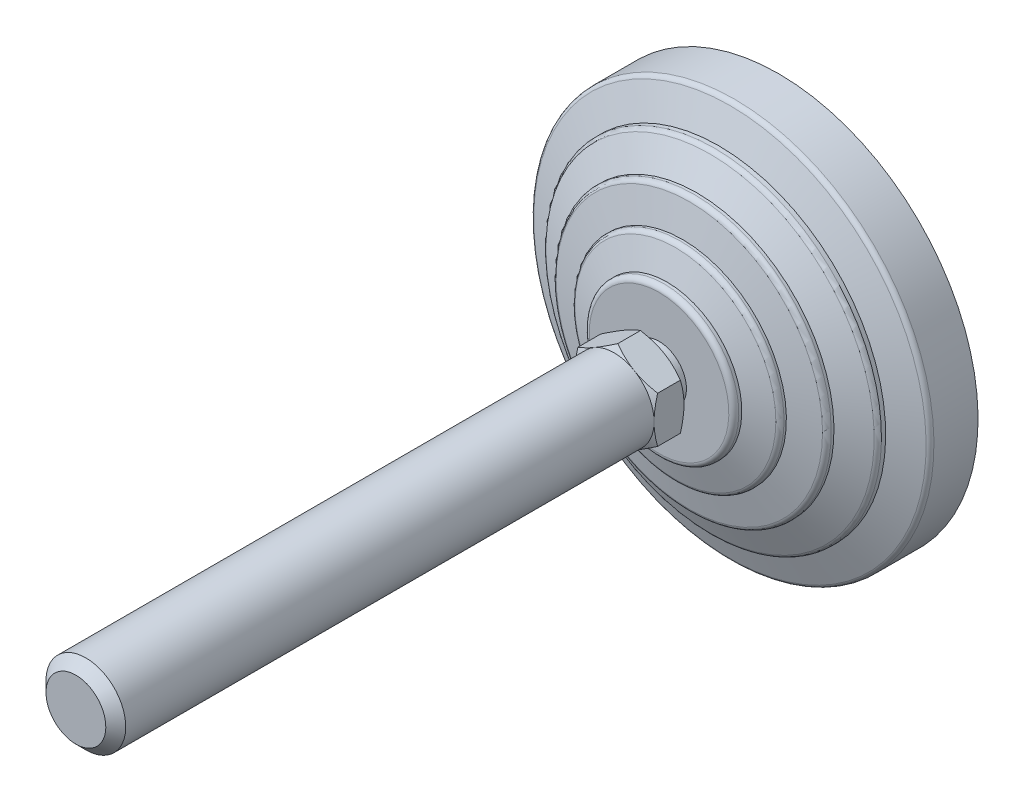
ISO-10303-21;
HEADER;
FILE_DESCRIPTION(('STEP AP214'),'2;1');
FILE_NAME('part.step','',(''),(''),'','','');
FILE_SCHEMA(('AUTOMOTIVE_DESIGN { 1 0 10303 214 1 1 1 1 }'));
ENDSEC;
DATA;
#1=APPLICATION_CONTEXT('core data for automotive mechanical design processes');
#2=APPLICATION_PROTOCOL_DEFINITION('international standard','automotive_design',2000,#1);
#3=PRODUCT_CONTEXT('',#1,'mechanical');
#4=PRODUCT('Part','Part','',(#3));
#5=PRODUCT_RELATED_PRODUCT_CATEGORY('part','',(#4));
#6=PRODUCT_DEFINITION_FORMATION('','',#4);
#7=PRODUCT_DEFINITION_CONTEXT('part definition',#1,'design');
#8=PRODUCT_DEFINITION('design','',#6,#7);
#9=PRODUCT_DEFINITION_SHAPE('','',#8);
#10=(LENGTH_UNIT() NAMED_UNIT(*) SI_UNIT(.MILLI.,.METRE.));
#11=(NAMED_UNIT(*) PLANE_ANGLE_UNIT() SI_UNIT($,.RADIAN.));
#12=(NAMED_UNIT(*) SI_UNIT($,.STERADIAN.) SOLID_ANGLE_UNIT());
#13=UNCERTAINTY_MEASURE_WITH_UNIT(LENGTH_MEASURE(1.E-05),#10,'distance_accuracy_value','');
#14=(GEOMETRIC_REPRESENTATION_CONTEXT(3) GLOBAL_UNCERTAINTY_ASSIGNED_CONTEXT((#13)) GLOBAL_UNIT_ASSIGNED_CONTEXT((#10,
#11,#12)) REPRESENTATION_CONTEXT('',''));
#15=CARTESIAN_POINT('',(0.,0.,0.));
#16=DIRECTION('',(0.,0.,1.));
#17=DIRECTION('',(1.,0.,0.));
#18=AXIS2_PLACEMENT_3D('',#15,#16,#17);
#19=CARTESIAN_POINT('',(-7.76470588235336,0.,27.));
#20=DIRECTION('',(0.,0.,1.));
#21=DIRECTION('',(0.,-1.,0.));
#22=AXIS2_PLACEMENT_3D('',#19,#20,#21);
#23=PLANE('',#22);
#24=CARTESIAN_POINT('',(0.,0.,27.));
#25=DIRECTION('',(0.,0.,-1.));
#26=DIRECTION('',(0.,1.,0.));
#27=AXIS2_PLACEMENT_3D('',#24,#25,#26);
#28=CIRCLE('',#27,5.5000000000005);
#29=CARTESIAN_POINT('',(0.,5.5000000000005,27.));
#30=VERTEX_POINT('',#29);
#31=EDGE_CURVE('E330',#30,#30,#28,.T.);
#32=ORIENTED_EDGE('',*,*,#31,.F.);
#33=EDGE_LOOP('',(#32));
#34=FACE_BOUND('',#33,.T.);
#35=CARTESIAN_POINT('',(0.,0.,27.));
#36=DIRECTION('',(0.,0.,-1.));
#37=DIRECTION('',(-1.,0.,0.));
#38=AXIS2_PLACEMENT_3D('',#35,#36,#37);
#39=CIRCLE('',#38,8.00000000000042);
#40=CARTESIAN_POINT('',(4.,6.92820323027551,27.));
#41=VERTEX_POINT('',#40);
#42=CARTESIAN_POINT('',(8.,0.,27.));
#43=VERTEX_POINT('',#42);
#44=EDGE_CURVE('E477',#41,#43,#39,.T.);
#45=ORIENTED_EDGE('',*,*,#44,.T.);
#46=CARTESIAN_POINT('',(4.,-6.92820323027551,27.));
#47=VERTEX_POINT('',#46);
#48=EDGE_CURVE('E140',#43,#47,#39,.T.);
#49=ORIENTED_EDGE('',*,*,#48,.T.);
#50=CARTESIAN_POINT('',(-4.,-6.92820323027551,27.));
#51=VERTEX_POINT('',#50);
#52=EDGE_CURVE('E139',#47,#51,#39,.T.);
#53=ORIENTED_EDGE('',*,*,#52,.T.);
#54=CARTESIAN_POINT('',(-8.,0.,27.));
#55=VERTEX_POINT('',#54);
#56=EDGE_CURVE('E117',#51,#55,#39,.T.);
#57=ORIENTED_EDGE('',*,*,#56,.T.);
#58=CARTESIAN_POINT('',(-4.,6.92820323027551,27.));
#59=VERTEX_POINT('',#58);
#60=EDGE_CURVE('E105',#55,#59,#39,.T.);
#61=ORIENTED_EDGE('',*,*,#60,.T.);
#62=EDGE_CURVE('E34',#59,#41,#39,.T.);
#63=ORIENTED_EDGE('',*,*,#62,.T.);
#64=EDGE_LOOP('',(#45,#49,#53,#57,#61,#63));
#65=FACE_BOUND('',#64,.T.);
#66=ADVANCED_FACE('F14',(#34,#65),#23,.F.);
#67=CARTESIAN_POINT('',(0.,0.,0.));
#68=DIRECTION('',(0.,0.,-1.));
#69=DIRECTION('',(0.,1.,0.));
#70=AXIS2_PLACEMENT_3D('',#67,#68,#69);
#71=CYLINDRICAL_SURFACE('',#70,5.5000000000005);
#72=CARTESIAN_POINT('',(0.,0.,24.));
#73=DIRECTION('',(0.,0.,-1.));
#74=DIRECTION('',(0.,1.,0.));
#75=AXIS2_PLACEMENT_3D('',#72,#73,#74);
#76=CIRCLE('',#75,5.5000000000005);
#77=CARTESIAN_POINT('',(0.,5.5000000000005,24.));
#78=VERTEX_POINT('',#77);
#79=EDGE_CURVE('E335',#78,#78,#76,.T.);
#80=ORIENTED_EDGE('',*,*,#79,.F.);
#81=EDGE_LOOP('',(#80));
#82=FACE_BOUND('',#81,.T.);
#83=ORIENTED_EDGE('',*,*,#31,.T.);
#84=EDGE_LOOP('',(#83));
#85=FACE_BOUND('',#84,.T.);
#86=ADVANCED_FACE('F297',(#82,#85),#71,.T.);
#87=CARTESIAN_POINT('',(-5.5000000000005,0.,24.));
#88=DIRECTION('',(0.,0.,-1.));
#89=DIRECTION('',(0.,1.,0.));
#90=AXIS2_PLACEMENT_3D('',#87,#88,#89);
#91=PLANE('',#90);
#92=CARTESIAN_POINT('',(0.,0.,24.));
#93=DIRECTION('',(0.,0.,-1.));
#94=DIRECTION('',(0.,1.,0.));
#95=AXIS2_PLACEMENT_3D('',#92,#93,#94);
#96=CIRCLE('',#95,13.9999999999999);
#97=CARTESIAN_POINT('',(0.,13.9999999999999,24.));
#98=VERTEX_POINT('',#97);
#99=EDGE_CURVE('E338',#98,#98,#96,.T.);
#100=ORIENTED_EDGE('',*,*,#99,.F.);
#101=EDGE_LOOP('',(#100));
#102=FACE_BOUND('',#101,.T.);
#103=ORIENTED_EDGE('',*,*,#79,.T.);
#104=EDGE_LOOP('',(#103));
#105=FACE_BOUND('',#104,.T.);
#106=ADVANCED_FACE('F293',(#102,#105),#91,.F.);
#107=CARTESIAN_POINT('',(0.,0.,23.));
#108=DIRECTION('',(0.,0.,-1.));
#109=DIRECTION('',(0.,1.,0.));
#110=AXIS2_PLACEMENT_3D('',#107,#108,#109);
#111=TOROIDAL_SURFACE('',#110,13.9999999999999,1.);
#112=CARTESIAN_POINT('',(0.,0.,23.));
#113=DIRECTION('',(0.,0.,-1.));
#114=DIRECTION('',(0.,1.,0.));
#115=AXIS2_PLACEMENT_3D('',#112,#113,#114);
#116=CIRCLE('',#115,14.9999999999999);
#117=CARTESIAN_POINT('',(0.,14.9999999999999,23.));
#118=VERTEX_POINT('',#117);
#119=EDGE_CURVE('E341',#118,#118,#116,.T.);
#120=ORIENTED_EDGE('',*,*,#119,.F.);
#121=EDGE_LOOP('',(#120));
#122=FACE_BOUND('',#121,.T.);
#123=ORIENTED_EDGE('',*,*,#99,.T.);
#124=EDGE_LOOP('',(#123));
#125=FACE_BOUND('',#124,.T.);
#126=ADVANCED_FACE('F289',(#122,#125),#111,.T.);
#127=CARTESIAN_POINT('',(0.,0.,0.));
#128=DIRECTION('',(0.,0.,-1.));
#129=DIRECTION('',(0.,1.,0.));
#130=AXIS2_PLACEMENT_3D('',#127,#128,#129);
#131=CYLINDRICAL_SURFACE('',#130,14.9999999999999);
#132=CARTESIAN_POINT('',(0.,0.,22.4025287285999));
#133=DIRECTION('',(0.,0.,-1.));
#134=DIRECTION('',(0.,1.,0.));
#135=AXIS2_PLACEMENT_3D('',#132,#133,#134);
#136=CIRCLE('',#135,14.9999999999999);
#137=CARTESIAN_POINT('',(0.,14.9999999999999,22.4025287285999));
#138=VERTEX_POINT('',#137);
#139=EDGE_CURVE('E344',#138,#138,#136,.T.);
#140=ORIENTED_EDGE('',*,*,#139,.F.);
#141=EDGE_LOOP('',(#140));
#142=FACE_BOUND('',#141,.T.);
#143=ORIENTED_EDGE('',*,*,#119,.T.);
#144=EDGE_LOOP('',(#143));
#145=FACE_BOUND('',#144,.T.);
#146=ADVANCED_FACE('F285',(#142,#145),#131,.T.);
#147=CARTESIAN_POINT('',(0.,0.,22.4025287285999));
#148=DIRECTION('',(0.,0.,-1.));
#149=DIRECTION('',(0.,1.,0.));
#150=AXIS2_PLACEMENT_3D('',#147,#148,#149);
#151=CONICAL_SURFACE('',#150,14.9999999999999,1.25589726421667);
#152=CARTESIAN_POINT('',(0.,0.,20.7216684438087));
#153=DIRECTION('',(0.,0.,-1.));
#154=DIRECTION('',(0.,1.,0.));
#155=AXIS2_PLACEMENT_3D('',#152,#153,#154);
#156=CIRCLE('',#155,20.1601635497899);
#157=CARTESIAN_POINT('',(0.,20.1601635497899,20.7216684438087));
#158=VERTEX_POINT('',#157);
#159=EDGE_CURVE('E347',#158,#158,#156,.T.);
#160=ORIENTED_EDGE('',*,*,#159,.F.);
#161=EDGE_LOOP('',(#160));
#162=FACE_BOUND('',#161,.T.);
#163=ORIENTED_EDGE('',*,*,#139,.T.);
#164=EDGE_LOOP('',(#163));
#165=FACE_BOUND('',#164,.T.);
#166=ADVANCED_FACE('F281',(#162,#165),#151,.T.);
#167=CARTESIAN_POINT('',(0.,0.,19.7708407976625));
#168=DIRECTION('',(0.,0.,-1.));
#169=DIRECTION('',(0.,1.,0.));
#170=AXIS2_PLACEMENT_3D('',#167,#168,#169);
#171=TOROIDAL_SURFACE('',#170,19.8504430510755,1.);
#172=CARTESIAN_POINT('',(0.,0.,19.7708407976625));
#173=DIRECTION('',(0.,0.,-1.));
#174=DIRECTION('',(0.,1.,0.));
#175=AXIS2_PLACEMENT_3D('',#172,#173,#174);
#176=CIRCLE('',#175,20.8504430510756);
#177=CARTESIAN_POINT('',(0.,20.8504430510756,19.7708407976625));
#178=VERTEX_POINT('',#177);
#179=EDGE_CURVE('E350',#178,#178,#176,.T.);
#180=ORIENTED_EDGE('',*,*,#179,.F.);
#181=EDGE_LOOP('',(#180));
#182=FACE_BOUND('',#181,.T.);
#183=ORIENTED_EDGE('',*,*,#159,.T.);
#184=EDGE_LOOP('',(#183));
#185=FACE_BOUND('',#184,.T.);
#186=ADVANCED_FACE('F277',(#182,#185),#171,.T.);
#187=CARTESIAN_POINT('',(0.,0.,0.));
#188=DIRECTION('',(0.,0.,-1.));
#189=DIRECTION('',(0.,1.,0.));
#190=AXIS2_PLACEMENT_3D('',#187,#188,#189);
#191=CYLINDRICAL_SURFACE('',#190,20.8504430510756);
#192=CARTESIAN_POINT('',(0.,0.,19.2987385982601));
#193=DIRECTION('',(0.,0.,-1.));
#194=DIRECTION('',(0.,1.,0.));
#195=AXIS2_PLACEMENT_3D('',#192,#193,#194);
#196=CIRCLE('',#195,20.8504430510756);
#197=CARTESIAN_POINT('',(0.,20.8504430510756,19.2987385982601));
#198=VERTEX_POINT('',#197);
#199=EDGE_CURVE('E353',#198,#198,#196,.T.);
#200=ORIENTED_EDGE('',*,*,#199,.F.);
#201=EDGE_LOOP('',(#200));
#202=FACE_BOUND('',#201,.T.);
#203=ORIENTED_EDGE('',*,*,#179,.T.);
#204=EDGE_LOOP('',(#203));
#205=FACE_BOUND('',#204,.T.);
#206=ADVANCED_FACE('F273',(#202,#205),#191,.T.);
#207=CARTESIAN_POINT('',(0.,0.,19.2987385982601));
#208=DIRECTION('',(0.,0.,-1.));
#209=DIRECTION('',(0.,1.,0.));
#210=AXIS2_PLACEMENT_3D('',#207,#208,#209);
#211=CONICAL_SURFACE('',#210,20.8504430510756,1.34067144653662);
#212=CARTESIAN_POINT('',(0.,0.,17.9217501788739));
#213=DIRECTION('',(0.,0.,-1.));
#214=DIRECTION('',(0.,1.,0.));
#215=AXIS2_PLACEMENT_3D('',#212,#213,#214);
#216=CIRCLE('',#215,26.7280991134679);
#217=CARTESIAN_POINT('',(0.,26.7280991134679,17.9217501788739));
#218=VERTEX_POINT('',#217);
#219=EDGE_CURVE('E356',#218,#218,#216,.T.);
#220=ORIENTED_EDGE('',*,*,#219,.F.);
#221=EDGE_LOOP('',(#220));
#222=FACE_BOUND('',#221,.T.);
#223=ORIENTED_EDGE('',*,*,#199,.T.);
#224=EDGE_LOOP('',(#223));
#225=FACE_BOUND('',#224,.T.);
#226=ADVANCED_FACE('F269',(#222,#225),#211,.T.);
#227=CARTESIAN_POINT('',(0.,0.,16.9481122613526));
#228=DIRECTION('',(0.,0.,-1.));
#229=DIRECTION('',(0.,1.,0.));
#230=AXIS2_PLACEMENT_3D('',#227,#228,#229);
#231=TOROIDAL_SURFACE('',#230,26.5,1.);
#232=CARTESIAN_POINT('',(0.,0.,16.9481122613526));
#233=DIRECTION('',(0.,0.,-1.));
#234=DIRECTION('',(0.,1.,0.));
#235=AXIS2_PLACEMENT_3D('',#232,#233,#234);
#236=CIRCLE('',#235,27.5);
#237=CARTESIAN_POINT('',(0.,27.5,16.9481122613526));
#238=VERTEX_POINT('',#237);
#239=EDGE_CURVE('E359',#238,#238,#236,.T.);
#240=ORIENTED_EDGE('',*,*,#239,.F.);
#241=EDGE_LOOP('',(#240));
#242=FACE_BOUND('',#241,.T.);
#243=ORIENTED_EDGE('',*,*,#219,.T.);
#244=EDGE_LOOP('',(#243));
#245=FACE_BOUND('',#244,.T.);
#246=ADVANCED_FACE('F265',(#242,#245),#231,.T.);
#247=CARTESIAN_POINT('',(0.,0.,0.));
#248=DIRECTION('',(0.,0.,-1.));
#249=DIRECTION('',(0.,1.,0.));
#250=AXIS2_PLACEMENT_3D('',#247,#248,#249);
#251=CYLINDRICAL_SURFACE('',#250,27.5);
#252=CARTESIAN_POINT('',(0.,0.,16.4025287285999));
#253=DIRECTION('',(0.,0.,-1.));
#254=DIRECTION('',(0.,1.,0.));
#255=AXIS2_PLACEMENT_3D('',#252,#253,#254);
#256=CIRCLE('',#255,27.5);
#257=CARTESIAN_POINT('',(0.,27.5,16.4025287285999));
#258=VERTEX_POINT('',#257);
#259=EDGE_CURVE('E362',#258,#258,#256,.T.);
#260=ORIENTED_EDGE('',*,*,#259,.F.);
#261=EDGE_LOOP('',(#260));
#262=FACE_BOUND('',#261,.T.);
#263=ORIENTED_EDGE('',*,*,#239,.T.);
#264=EDGE_LOOP('',(#263));
#265=FACE_BOUND('',#264,.T.);
#266=ADVANCED_FACE('F261',(#262,#265),#251,.T.);
#267=CARTESIAN_POINT('',(0.,0.,16.4025287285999));
#268=DIRECTION('',(0.,0.,-1.));
#269=DIRECTION('',(0.,1.,0.));
#270=AXIS2_PLACEMENT_3D('',#267,#268,#269);
#271=CONICAL_SURFACE('',#270,27.5,1.12022914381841);
#272=CARTESIAN_POINT('',(0.,0.,13.7730910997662));
#273=DIRECTION('',(0.,0.,-1.));
#274=DIRECTION('',(0.,1.,0.));
#275=AXIS2_PLACEMENT_3D('',#272,#273,#274);
#276=CIRCLE('',#275,32.935476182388);
#277=CARTESIAN_POINT('',(0.,32.935476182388,13.7730910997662));
#278=VERTEX_POINT('',#277);
#279=EDGE_CURVE('E365',#278,#278,#276,.T.);
#280=ORIENTED_EDGE('',*,*,#279,.F.);
#281=EDGE_LOOP('',(#280));
#282=FACE_BOUND('',#281,.T.);
#283=ORIENTED_EDGE('',*,*,#259,.T.);
#284=EDGE_LOOP('',(#283));
#285=FACE_BOUND('',#284,.T.);
#286=ADVANCED_FACE('F257',(#282,#285),#271,.T.);
#287=CARTESIAN_POINT('',(0.,0.,12.8728908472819));
#288=DIRECTION('',(0.,0.,-1.));
#289=DIRECTION('',(0.,1.,0.));
#290=AXIS2_PLACEMENT_3D('',#287,#288,#289);
#291=TOROIDAL_SURFACE('',#290,32.5,1.);
#292=CARTESIAN_POINT('',(0.,0.,12.8728908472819));
#293=DIRECTION('',(0.,0.,-1.));
#294=DIRECTION('',(0.,1.,0.));
#295=AXIS2_PLACEMENT_3D('',#292,#293,#294);
#296=CIRCLE('',#295,33.5);
#297=CARTESIAN_POINT('',(0.,33.5,12.8728908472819));
#298=VERTEX_POINT('',#297);
#299=EDGE_CURVE('E368',#298,#298,#296,.T.);
#300=ORIENTED_EDGE('',*,*,#299,.F.);
#301=EDGE_LOOP('',(#300));
#302=FACE_BOUND('',#301,.T.);
#303=ORIENTED_EDGE('',*,*,#279,.T.);
#304=EDGE_LOOP('',(#303));
#305=FACE_BOUND('',#304,.T.);
#306=ADVANCED_FACE('F253',(#302,#305),#291,.T.);
#307=CARTESIAN_POINT('',(0.,0.,0.));
#308=DIRECTION('',(0.,0.,-1.));
#309=DIRECTION('',(0.,1.,0.));
#310=AXIS2_PLACEMENT_3D('',#307,#308,#309);
#311=CYLINDRICAL_SURFACE('',#310,33.5);
#312=CARTESIAN_POINT('',(0.,0.,12.0315037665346));
#313=DIRECTION('',(0.,0.,-1.));
#314=DIRECTION('',(0.,1.,0.));
#315=AXIS2_PLACEMENT_3D('',#312,#313,#314);
#316=CIRCLE('',#315,33.5);
#317=CARTESIAN_POINT('',(0.,33.5,12.0315037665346));
#318=VERTEX_POINT('',#317);
#319=EDGE_CURVE('E371',#318,#318,#316,.T.);
#320=ORIENTED_EDGE('',*,*,#319,.F.);
#321=EDGE_LOOP('',(#320));
#322=FACE_BOUND('',#321,.T.);
#323=ORIENTED_EDGE('',*,*,#299,.T.);
#324=EDGE_LOOP('',(#323));
#325=FACE_BOUND('',#324,.T.);
#326=ADVANCED_FACE('F249',(#322,#325),#311,.T.);
#327=CARTESIAN_POINT('',(0.,0.,12.0315037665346));
#328=DIRECTION('',(0.,0.,-1.));
#329=DIRECTION('',(0.,1.,0.));
#330=AXIS2_PLACEMENT_3D('',#327,#328,#329);
#331=CONICAL_SURFACE('',#330,33.5,1.20362249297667);
#332=CARTESIAN_POINT('',(0.,0.,9.77805027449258));
#333=DIRECTION('',(0.,0.,-1.));
#334=DIRECTION('',(0.,1.,0.));
#335=AXIS2_PLACEMENT_3D('',#332,#333,#334);
#336=CIRCLE('',#335,39.3589790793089);
#337=CARTESIAN_POINT('',(0.,39.3589790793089,9.77805027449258));
#338=VERTEX_POINT('',#337);
#339=EDGE_CURVE('E374',#338,#338,#336,.T.);
#340=ORIENTED_EDGE('',*,*,#339,.F.);
#341=EDGE_LOOP('',(#340));
#342=FACE_BOUND('',#341,.T.);
#343=ORIENTED_EDGE('',*,*,#319,.T.);
#344=EDGE_LOOP('',(#343));
#345=FACE_BOUND('',#344,.T.);
#346=ADVANCED_FACE('F245',(#342,#345),#331,.T.);
#347=CARTESIAN_POINT('',(0.,0.,8.84470466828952));
#348=DIRECTION('',(0.,0.,-1.));
#349=DIRECTION('',(0.,1.,0.));
#350=AXIS2_PLACEMENT_3D('',#347,#348,#349);
#351=TOROIDAL_SURFACE('',#350,39.,1.);
#352=CARTESIAN_POINT('',(0.,0.,8.84470466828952));
#353=DIRECTION('',(0.,0.,-1.));
#354=DIRECTION('',(0.,1.,0.));
#355=AXIS2_PLACEMENT_3D('',#352,#353,#354);
#356=CIRCLE('',#355,40.);
#357=CARTESIAN_POINT('',(0.,40.,8.84470466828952));
#358=VERTEX_POINT('',#357);
#359=EDGE_CURVE('E377',#358,#358,#356,.T.);
#360=ORIENTED_EDGE('',*,*,#359,.F.);
#361=EDGE_LOOP('',(#360));
#362=FACE_BOUND('',#361,.T.);
#363=ORIENTED_EDGE('',*,*,#339,.T.);
#364=EDGE_LOOP('',(#363));
#365=FACE_BOUND('',#364,.T.);
#366=ADVANCED_FACE('F241',(#362,#365),#351,.T.);
#367=CARTESIAN_POINT('',(0.,0.,0.));
#368=DIRECTION('',(0.,0.,-1.));
#369=DIRECTION('',(0.,1.,0.));
#370=AXIS2_PLACEMENT_3D('',#367,#368,#369);
#371=CYLINDRICAL_SURFACE('',#370,40.);
#372=CARTESIAN_POINT('',(0.,0.,0.));
#373=DIRECTION('',(0.,0.,-1.));
#374=DIRECTION('',(0.,1.,0.));
#375=AXIS2_PLACEMENT_3D('',#372,#373,#374);
#376=CIRCLE('',#375,40.);
#377=CARTESIAN_POINT('',(0.,40.,0.));
#378=VERTEX_POINT('',#377);
#379=EDGE_CURVE('E380',#378,#378,#376,.T.);
#380=ORIENTED_EDGE('',*,*,#379,.F.);
#381=EDGE_LOOP('',(#380));
#382=FACE_BOUND('',#381,.T.);
#383=ORIENTED_EDGE('',*,*,#359,.T.);
#384=EDGE_LOOP('',(#383));
#385=FACE_BOUND('',#384,.T.);
#386=ADVANCED_FACE('F237',(#382,#385),#371,.T.);
#387=CARTESIAN_POINT('',(0.,0.,0.));
#388=DIRECTION('',(0.,0.,1.));
#389=DIRECTION('',(0.,-1.,0.));
#390=AXIS2_PLACEMENT_3D('',#387,#388,#389);
#391=PLANE('',#390);
#392=ORIENTED_EDGE('',*,*,#379,.T.);
#393=EDGE_LOOP('',(#392));
#394=FACE_BOUND('',#393,.T.);
#395=ADVANCED_FACE('F233',(#394),#391,.F.);
#396=CARTESIAN_POINT('',(0.,0.,28.6561732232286));
#397=DIRECTION('',(0.,0.,1.));
#398=DIRECTION('',(1.,0.,0.));
#399=AXIS2_PLACEMENT_3D('',#396,#397,#398);
#400=CONICAL_SURFACE('',#399,10.8685761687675,1.0471975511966);
#401=CARTESIAN_POINT('',(8.,-12.3808346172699,30.8916828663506));
#402=CARTESIAN_POINT('',(8.,-12.0316442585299,30.7223982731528));
#403=CARTESIAN_POINT('',(8.,-11.6816495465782,30.5547443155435));
#404=CARTESIAN_POINT('',(8.,-10.9796235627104,30.2236152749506));
#405=CARTESIAN_POINT('',(8.,-10.6275919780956,30.0601408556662));
#406=CARTESIAN_POINT('',(8.,-9.91923813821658,29.7374604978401));
#407=CARTESIAN_POINT('',(8.,-9.56290294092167,29.5782828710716));
#408=CARTESIAN_POINT('',(8.,-8.84738945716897,29.2664760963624));
#409=CARTESIAN_POINT('',(8.,-8.48821130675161,29.1138466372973));
#410=CARTESIAN_POINT('',(8.,-7.75493332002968,28.8121311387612));
#411=CARTESIAN_POINT('',(8.,-7.38072266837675,28.6633129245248));
#412=CARTESIAN_POINT('',(8.,-6.62791468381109,28.3770022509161));
#413=CARTESIAN_POINT('',(8.,-6.24931686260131,28.2395110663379));
#414=CARTESIAN_POINT('',(8.,-5.48784470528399,27.9794833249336));
#415=CARTESIAN_POINT('',(8.,-5.10498089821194,27.8569162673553));
#416=CARTESIAN_POINT('',(8.,-4.33377518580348,27.6306851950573));
#417=CARTESIAN_POINT('',(8.,-3.94543505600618,27.5270151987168));
#418=CARTESIAN_POINT('',(8.,-3.16514933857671,27.3441292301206));
#419=CARTESIAN_POINT('',(8.,-2.77323556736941,27.2647811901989));
#420=CARTESIAN_POINT('',(8.,-2.18181668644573,27.1674470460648));
#421=CARTESIAN_POINT('',(8.,-1.9840709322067,27.1386156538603));
#422=CARTESIAN_POINT('',(8.,-1.58760533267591,27.0887482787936));
#423=CARTESIAN_POINT('',(8.,-1.38888558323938,27.0677115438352));
#424=CARTESIAN_POINT('',(8.,-0.993322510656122,27.0341150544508));
#425=CARTESIAN_POINT('',(8.,-0.796488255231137,27.0214489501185));
#426=CARTESIAN_POINT('',(8.,-0.402460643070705,27.0044500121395));
#427=CARTESIAN_POINT('',(8.,-0.205267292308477,27.0001170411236));
#428=CARTESIAN_POINT('',(8.,0.189126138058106,26.9998876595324));
#429=CARTESIAN_POINT('',(8.,0.386326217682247,27.0039912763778));
#430=CARTESIAN_POINT('',(8.,0.780378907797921,27.0205352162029));
#431=CARTESIAN_POINT('',(8.,0.977231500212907,27.0329759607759));
#432=CARTESIAN_POINT('',(8.,1.45112600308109,27.0726983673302));
#433=CARTESIAN_POINT('',(8.,1.72783961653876,27.1039800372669));
#434=CARTESIAN_POINT('',(8.,2.27918294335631,27.1813043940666));
#435=CARTESIAN_POINT('',(8.,2.55381236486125,27.2273491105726));
#436=CARTESIAN_POINT('',(8.,3.37427820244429,27.3851837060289));
#437=CARTESIAN_POINT('',(8.,3.91637890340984,27.5166443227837));
#438=CARTESIAN_POINT('',(8.,4.72690391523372,27.7442258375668));
#439=CARTESIAN_POINT('',(8.,4.99954243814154,27.826197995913));
#440=CARTESIAN_POINT('',(8.,5.54217090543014,27.9985621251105));
#441=CARTESIAN_POINT('',(8.,5.81216083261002,28.0889541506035));
#442=CARTESIAN_POINT('',(8.,6.34957858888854,28.2767155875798));
#443=CARTESIAN_POINT('',(8.,6.61700725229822,28.3740826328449));
#444=CARTESIAN_POINT('',(8.,7.14965550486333,28.5746579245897));
#445=CARTESIAN_POINT('',(8.,7.41487511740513,28.6778661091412));
#446=CARTESIAN_POINT('',(8.,8.03035763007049,28.9239381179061));
#447=CARTESIAN_POINT('',(8.,8.37987183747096,29.0686708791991));
#448=CARTESIAN_POINT('',(8.,9.07600620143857,29.3649558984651));
#449=CARTESIAN_POINT('',(8.,9.42262619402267,29.5165085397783));
#450=CARTESIAN_POINT('',(8.,10.1134898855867,29.8250941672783));
#451=CARTESIAN_POINT('',(8.,10.457733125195,29.9821281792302));
#452=CARTESIAN_POINT('',(8.,11.1441780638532,30.300604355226));
#453=CARTESIAN_POINT('',(8.,11.486379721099,30.4620466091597));
#454=CARTESIAN_POINT('',(8.,12.1694081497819,30.788691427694));
#455=CARTESIAN_POINT('',(8.,12.5102331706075,30.9538976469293));
#456=CARTESIAN_POINT('',(8.,13.1904267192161,31.2872844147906));
#457=CARTESIAN_POINT('',(8.,13.5297952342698,31.455464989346));
#458=CARTESIAN_POINT('',(8.,14.5459723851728,31.9636502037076));
#459=CARTESIAN_POINT('',(8.,15.2209381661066,32.3073395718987));
#460=CARTESIAN_POINT('',(8.,16.5124825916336,32.9734162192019));
#461=CARTESIAN_POINT('',(8.,17.1293423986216,33.2952607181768));
#462=CARTESIAN_POINT('',(8.,18.3607476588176,33.943392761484));
#463=CARTESIAN_POINT('',(8.,18.9752930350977,34.2696804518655));
#464=CARTESIAN_POINT('',(8.,20.2011044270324,34.9248669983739));
#465=CARTESIAN_POINT('',(8.,20.8123747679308,35.253757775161));
#466=CARTESIAN_POINT('',(8.,22.033429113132,35.9142112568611));
#467=CARTESIAN_POINT('',(8.,22.6432131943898,36.2457738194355));
#468=CARTESIAN_POINT('',(8.,23.2524472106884,36.5783372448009));
#469=B_SPLINE_CURVE_WITH_KNOTS('',3,(#401,#402,#403,#404,#405,#406,#407,#408,#409,#410,#411,
#412,#413,#414,#415,#416,#417,#418,#419,#420,#421,#422,#423,#424,#425,#426,#427,#428,#429,#430,
#431,#432,#433,#434,#435,#436,#437,#438,#439,#440,#441,#442,#443,#444,#445,#446,#447,#448,#449,
#450,#451,#452,#453,#454,#455,#456,#457,#458,#459,#460,#461,#462,#463,#464,#465,#466,#467,#468),
.UNSPECIFIED.,.F.,.F.,(4,2,2,2,2,2,2,2,2,2,2,2,2,2,2,2,2,2,2,2,2,2,2,2,2,2,2,2,2,2,2,2,2,4),(0.,
1.16419672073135,2.32857717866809,3.49934061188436,4.67004835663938,5.87805519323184,
7.08619779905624,8.29182831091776,9.49707653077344,10.695659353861,11.2950394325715,
11.8943616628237,12.4859150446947,13.0774586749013,13.6690042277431,14.260579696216,
15.0955357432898,15.9306066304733,17.601688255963,18.4557029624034,19.3097232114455,
20.1634551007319,21.0171779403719,22.1519691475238,23.2868242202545,24.4218928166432,
25.5569845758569,26.693229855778,27.8294850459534,30.101710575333,32.1890098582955,
34.276377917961,36.3587697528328,38.4410513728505),.UNSPECIFIED.);
#470=CARTESIAN_POINT('',(8.,4.61880215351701,27.714531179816));
#471=VERTEX_POINT('',#470);
#472=EDGE_CURVE('E115',#471,#43,#469,.F.);
#473=ORIENTED_EDGE('',*,*,#472,.T.);
#474=ORIENTED_EDGE('',*,*,#44,.F.);
#475=CARTESIAN_POINT('',(-0.00019999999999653,9.23771977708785,27.7145978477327));
#476=CARTESIAN_POINT('',(0.175648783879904,9.13619343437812,27.655990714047));
#477=CARTESIAN_POINT('',(0.352153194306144,9.03428856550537,27.600043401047));
#478=CARTESIAN_POINT('',(0.70659546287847,8.82965122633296,27.4942010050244));
#479=CARTESIAN_POINT('',(0.884533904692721,8.72691841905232,27.4443085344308));
#480=CARTESIAN_POINT('',(1.42119823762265,8.41707512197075,27.3046927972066));
#481=CARTESIAN_POINT('',(1.78204258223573,8.20874154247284,27.2252811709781));
#482=CARTESIAN_POINT('',(2.32203917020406,7.89697436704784,27.1321616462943));
#483=CARTESIAN_POINT('',(2.49957818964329,7.79447216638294,27.1056345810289));
#484=CARTESIAN_POINT('',(2.85545911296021,7.58900421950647,27.0611531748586));
#485=CARTESIAN_POINT('',(3.03380094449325,7.4860385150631,27.0431980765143));
#486=CARTESIAN_POINT('',(3.3907916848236,7.27992981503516,27.0163156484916));
#487=CARTESIAN_POINT('',(3.56944001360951,7.17678715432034,27.007378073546));
#488=CARTESIAN_POINT('',(3.92690170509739,6.97040655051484,26.9987223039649));
#489=CARTESIAN_POINT('',(4.10571506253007,6.86716861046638,26.9990038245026));
#490=CARTESIAN_POINT('',(4.44001336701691,6.67416139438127,27.0081450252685));
#491=CARTESIAN_POINT('',(4.59552190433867,6.58437849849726,27.0158896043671));
#492=CARTESIAN_POINT('',(4.90617476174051,6.40502298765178,27.0382011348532));
#493=CARTESIAN_POINT('',(5.06131905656,6.31545038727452,27.0527685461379));
#494=CARTESIAN_POINT('',(5.52615131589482,6.04707935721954,27.1063606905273));
#495=CARTESIAN_POINT('',(5.83501648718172,5.86875596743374,27.1552686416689));
#496=CARTESIAN_POINT('',(6.4560232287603,5.51021755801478,27.2775394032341));
#497=CARTESIAN_POINT('',(6.76808554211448,5.33004829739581,27.3514205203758));
#498=CARTESIAN_POINT('',(7.38755648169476,4.97239658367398,27.5191001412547));
#499=CARTESIAN_POINT('',(7.69497304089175,4.79490955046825,27.6128592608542));
#500=CARTESIAN_POINT('',(8.0002,4.61868668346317,27.7145978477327));
#501=B_SPLINE_CURVE_WITH_KNOTS('',3,(#475,#476,#477,#478,#479,#480,#481,#482,#483,#484,#485,
#486,#487,#488,#489,#490,#491,#492,#493,#494,#495,#496,#497,#498,#499,#500),.UNSPECIFIED.,.F.,
.F.,(4,2,2,2,2,2,2,2,2,2,2,2,4),(0.,0.633973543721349,1.26821965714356,2.53934712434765,
3.15934343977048,3.77928496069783,4.39852133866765,5.01773858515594,5.55680239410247,
6.09590254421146,7.17487077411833,8.27776850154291,9.37850115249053),.UNSPECIFIED.);
#502=EDGE_CURVE('E18',#41,#471,#501,.T.);
#503=ORIENTED_EDGE('',*,*,#502,.T.);
#504=EDGE_LOOP('',(#473,#474,#503));
#505=FACE_BOUND('',#504,.T.);
#506=ADVANCED_FACE('F157',(#505),#400,.T.);
#507=CARTESIAN_POINT('',(-8.0002,4.61868668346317,27.7145978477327));
#508=CARTESIAN_POINT('',(-7.82435121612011,4.7202130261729,27.6559907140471));
#509=CARTESIAN_POINT('',(-7.64784680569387,4.82211789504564,27.6000434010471));
#510=CARTESIAN_POINT('',(-7.29340453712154,5.02675523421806,27.4942010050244));
#511=CARTESIAN_POINT('',(-7.11546609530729,5.1294880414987,27.4443085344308));
#512=CARTESIAN_POINT('',(-6.57880176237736,5.43933133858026,27.3046927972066));
#513=CARTESIAN_POINT('',(-6.21795741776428,5.64766491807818,27.2252811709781));
#514=CARTESIAN_POINT('',(-5.67796082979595,5.95943209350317,27.1321616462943));
#515=CARTESIAN_POINT('',(-5.50042181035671,6.06193429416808,27.1056345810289));
#516=CARTESIAN_POINT('',(-5.1445408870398,6.26740224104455,27.0611531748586));
#517=CARTESIAN_POINT('',(-4.96619905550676,6.37036794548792,27.0431980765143));
#518=CARTESIAN_POINT('',(-4.6092083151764,6.57647664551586,27.0163156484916));
#519=CARTESIAN_POINT('',(-4.4305599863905,6.67961930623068,27.007378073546));
#520=CARTESIAN_POINT('',(-4.07309829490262,6.88599991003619,26.9987223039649));
#521=CARTESIAN_POINT('',(-3.89428493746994,6.98923785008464,26.9990038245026));
#522=CARTESIAN_POINT('',(-3.5599866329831,7.18224506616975,27.0081450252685));
#523=CARTESIAN_POINT('',(-3.40447809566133,7.27202796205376,27.0158896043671));
#524=CARTESIAN_POINT('',(-3.09382523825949,7.45138347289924,27.0382011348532));
#525=CARTESIAN_POINT('',(-2.93868094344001,7.54095607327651,27.0527685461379));
#526=CARTESIAN_POINT('',(-2.47384868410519,7.80932710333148,27.1063606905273));
#527=CARTESIAN_POINT('',(-2.16498351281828,7.98765049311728,27.1552686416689));
#528=CARTESIAN_POINT('',(-1.5439767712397,8.34618890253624,27.2775394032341));
#529=CARTESIAN_POINT('',(-1.23191445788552,8.52635816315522,27.3514205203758));
#530=CARTESIAN_POINT('',(-0.612443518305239,8.88400987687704,27.5191001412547));
#531=CARTESIAN_POINT('',(-0.305026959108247,9.06149691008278,27.6128592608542));
#532=CARTESIAN_POINT('',(0.000200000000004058,9.23771977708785,27.7145978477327));
#533=B_SPLINE_CURVE_WITH_KNOTS('',3,(#507,#508,#509,#510,#511,#512,#513,#514,#515,#516,#517,
#518,#519,#520,#521,#522,#523,#524,#525,#526,#527,#528,#529,#530,#531,#532),.UNSPECIFIED.,.F.,
.F.,(4,2,2,2,2,2,2,2,2,2,2,2,4),(0.,0.63397354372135,1.26821965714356,2.53934712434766,
3.15934343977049,3.77928496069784,4.39852133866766,5.01773858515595,5.55680239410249,
6.09590254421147,7.17487077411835,8.27776850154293,9.37850115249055),.UNSPECIFIED.);
#534=CARTESIAN_POINT('',(0.,9.23760430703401,27.714531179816));
#535=VERTEX_POINT('',#534);
#536=EDGE_CURVE('E149',#59,#535,#533,.T.);
#537=ORIENTED_EDGE('',*,*,#536,.T.);
#538=EDGE_CURVE('E9',#535,#41,#501,.T.);
#539=ORIENTED_EDGE('',*,*,#538,.T.);
#540=ORIENTED_EDGE('',*,*,#62,.F.);
#541=EDGE_LOOP('',(#537,#539,#540));
#542=FACE_BOUND('',#541,.T.);
#543=ADVANCED_FACE('F470',(#542),#400,.T.);
#544=CARTESIAN_POINT('',(8.0002,-4.61868668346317,27.7145978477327));
#545=CARTESIAN_POINT('',(7.82435121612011,-4.7202130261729,27.6559907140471));
#546=CARTESIAN_POINT('',(7.64784680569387,-4.82211789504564,27.6000434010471));
#547=CARTESIAN_POINT('',(7.29340453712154,-5.02675523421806,27.4942010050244));
#548=CARTESIAN_POINT('',(7.11546609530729,-5.1294880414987,27.4443085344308));
#549=CARTESIAN_POINT('',(6.57880176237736,-5.43933133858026,27.3046927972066));
#550=CARTESIAN_POINT('',(6.21795741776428,-5.64766491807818,27.2252811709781));
#551=CARTESIAN_POINT('',(5.67796082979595,-5.95943209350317,27.1321616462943));
#552=CARTESIAN_POINT('',(5.50042181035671,-6.06193429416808,27.1056345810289));
#553=CARTESIAN_POINT('',(5.1445408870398,-6.26740224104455,27.0611531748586));
#554=CARTESIAN_POINT('',(4.96619905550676,-6.37036794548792,27.0431980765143));
#555=CARTESIAN_POINT('',(4.6092083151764,-6.57647664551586,27.0163156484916));
#556=CARTESIAN_POINT('',(4.4305599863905,-6.67961930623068,27.007378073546));
#557=CARTESIAN_POINT('',(4.07309829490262,-6.88599991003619,26.9987223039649));
#558=CARTESIAN_POINT('',(3.89428493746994,-6.98923785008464,26.9990038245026));
#559=CARTESIAN_POINT('',(3.5599866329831,-7.18224506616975,27.0081450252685));
#560=CARTESIAN_POINT('',(3.40447809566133,-7.27202796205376,27.0158896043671));
#561=CARTESIAN_POINT('',(3.09382523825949,-7.45138347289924,27.0382011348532));
#562=CARTESIAN_POINT('',(2.93868094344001,-7.5409560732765,27.0527685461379));
#563=CARTESIAN_POINT('',(2.47384868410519,-7.80932710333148,27.1063606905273));
#564=CARTESIAN_POINT('',(2.16498351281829,-7.98765049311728,27.1552686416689));
#565=CARTESIAN_POINT('',(1.5439767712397,-8.34618890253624,27.2775394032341));
#566=CARTESIAN_POINT('',(1.23191445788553,-8.52635816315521,27.3514205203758));
#567=CARTESIAN_POINT('',(0.612443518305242,-8.88400987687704,27.5191001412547));
#568=CARTESIAN_POINT('',(0.30502695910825,-9.06149691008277,27.6128592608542));
#569=CARTESIAN_POINT('',(-0.000200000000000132,-9.23771977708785,27.7145978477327));
#570=B_SPLINE_CURVE_WITH_KNOTS('',3,(#544,#545,#546,#547,#548,#549,#550,#551,#552,#553,#554,
#555,#556,#557,#558,#559,#560,#561,#562,#563,#564,#565,#566,#567,#568,#569),.UNSPECIFIED.,.F.,
.F.,(4,2,2,2,2,2,2,2,2,2,2,2,4),(0.,0.63397354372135,1.26821965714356,2.53934712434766,
3.15934343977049,3.77928496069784,4.39852133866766,5.01773858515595,5.55680239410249,
6.09590254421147,7.17487077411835,8.27776850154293,9.37850115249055),.UNSPECIFIED.);
#571=CARTESIAN_POINT('',(8.,-4.61880215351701,27.714531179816));
#572=VERTEX_POINT('',#571);
#573=EDGE_CURVE('E135',#572,#47,#570,.T.);
#574=ORIENTED_EDGE('',*,*,#573,.T.);
#575=ORIENTED_EDGE('',*,*,#48,.F.);
#576=EDGE_CURVE('E150',#43,#572,#469,.F.);
#577=ORIENTED_EDGE('',*,*,#576,.T.);
#578=EDGE_LOOP('',(#574,#575,#577));
#579=FACE_BOUND('',#578,.T.);
#580=ADVANCED_FACE('F464',(#579),#400,.T.);
#581=CARTESIAN_POINT('',(0.000200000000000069,-9.23771977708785,27.7145978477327));
#582=CARTESIAN_POINT('',(-0.175648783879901,-9.13619343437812,27.655990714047));
#583=CARTESIAN_POINT('',(-0.352153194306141,-9.03428856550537,27.600043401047));
#584=CARTESIAN_POINT('',(-0.706595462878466,-8.82965122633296,27.4942010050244));
#585=CARTESIAN_POINT('',(-0.884533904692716,-8.72691841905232,27.4443085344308));
#586=CARTESIAN_POINT('',(-1.42119823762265,-8.41707512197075,27.3046927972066));
#587=CARTESIAN_POINT('',(-1.78204258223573,-8.20874154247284,27.2252811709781));
#588=CARTESIAN_POINT('',(-2.32203917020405,-7.89697436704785,27.1321616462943));
#589=CARTESIAN_POINT('',(-2.49957818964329,-7.79447216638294,27.1056345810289));
#590=CARTESIAN_POINT('',(-2.8554591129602,-7.58900421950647,27.0611531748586));
#591=CARTESIAN_POINT('',(-3.03380094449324,-7.4860385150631,27.0431980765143));
#592=CARTESIAN_POINT('',(-3.3907916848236,-7.27992981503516,27.0163156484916));
#593=CARTESIAN_POINT('',(-3.5694400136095,-7.17678715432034,27.007378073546));
#594=CARTESIAN_POINT('',(-3.92690170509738,-6.97040655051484,26.9987223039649));
#595=CARTESIAN_POINT('',(-4.10571506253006,-6.86716861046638,26.9990038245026));
#596=CARTESIAN_POINT('',(-4.4400133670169,-6.67416139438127,27.0081450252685));
#597=CARTESIAN_POINT('',(-4.59552190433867,-6.58437849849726,27.0158896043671));
#598=CARTESIAN_POINT('',(-4.90617476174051,-6.40502298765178,27.0382011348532));
#599=CARTESIAN_POINT('',(-5.06131905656,-6.31545038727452,27.0527685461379));
#600=CARTESIAN_POINT('',(-5.52615131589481,-6.04707935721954,27.1063606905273));
#601=CARTESIAN_POINT('',(-5.83501648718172,-5.86875596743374,27.1552686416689));
#602=CARTESIAN_POINT('',(-6.4560232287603,-5.51021755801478,27.2775394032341));
#603=CARTESIAN_POINT('',(-6.76808554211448,-5.3300482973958,27.3514205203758));
#604=CARTESIAN_POINT('',(-7.38755648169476,-4.97239658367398,27.5191001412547));
#605=CARTESIAN_POINT('',(-7.69497304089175,-4.79490955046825,27.6128592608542));
#606=CARTESIAN_POINT('',(-8.0002,-4.61868668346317,27.7145978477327));
#607=B_SPLINE_CURVE_WITH_KNOTS('',3,(#581,#582,#583,#584,#585,#586,#587,#588,#589,#590,#591,
#592,#593,#594,#595,#596,#597,#598,#599,#600,#601,#602,#603,#604,#605,#606),.UNSPECIFIED.,.F.,
.F.,(4,2,2,2,2,2,2,2,2,2,2,2,4),(0.,0.633973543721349,1.26821965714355,2.53934712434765,
3.15934343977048,3.77928496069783,4.39852133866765,5.01773858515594,5.55680239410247,
6.09590254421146,7.17487077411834,8.27776850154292,9.37850115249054),.UNSPECIFIED.);
#608=CARTESIAN_POINT('',(0.,-9.23760430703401,27.714531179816));
#609=VERTEX_POINT('',#608);
#610=EDGE_CURVE('E415',#609,#51,#607,.T.);
#611=ORIENTED_EDGE('',*,*,#610,.T.);
#612=ORIENTED_EDGE('',*,*,#52,.F.);
#613=EDGE_CURVE('E128',#47,#609,#570,.T.);
#614=ORIENTED_EDGE('',*,*,#613,.T.);
#615=EDGE_LOOP('',(#611,#612,#614));
#616=FACE_BOUND('',#615,.T.);
#617=ADVANCED_FACE('F458',(#616),#400,.T.);
#618=CARTESIAN_POINT('',(-8.,-4.618802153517,27.714531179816));
#619=VERTEX_POINT('',#618);
#620=EDGE_CURVE('E124',#51,#619,#607,.T.);
#621=ORIENTED_EDGE('',*,*,#620,.T.);
#622=CARTESIAN_POINT('',(-8.,-12.3808346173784,30.8916828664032));
#623=CARTESIAN_POINT('',(-8.,-12.0316442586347,30.7223982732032));
#624=CARTESIAN_POINT('',(-8.,-11.6816495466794,30.5547443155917));
#625=CARTESIAN_POINT('',(-8.,-10.9796235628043,30.2236152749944));
#626=CARTESIAN_POINT('',(-8.,-10.6275919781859,30.0601408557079));
#627=CARTESIAN_POINT('',(-8.,-9.91923813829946,29.7374604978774));
#628=CARTESIAN_POINT('',(-8.,-9.56290294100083,29.5782828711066));
#629=CARTESIAN_POINT('',(-8.,-8.84738945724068,29.2664760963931));
#630=CARTESIAN_POINT('',(-8.,-8.48821130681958,29.1138466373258));
#631=CARTESIAN_POINT('',(-8.,-7.75493332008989,28.8121311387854));
#632=CARTESIAN_POINT('',(-8.,-7.38072266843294,28.6633129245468));
#633=CARTESIAN_POINT('',(-8.,-6.62791468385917,28.3770022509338));
#634=CARTESIAN_POINT('',(-8.,-6.2493168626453,28.2395110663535));
#635=CARTESIAN_POINT('',(-8.,-5.48784470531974,27.9794833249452));
#636=CARTESIAN_POINT('',(-8.,-5.10498089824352,27.8569162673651));
#637=CARTESIAN_POINT('',(-8.,-4.33377518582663,27.6306851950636));
#638=CARTESIAN_POINT('',(-8.,-3.94543505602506,27.5270151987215));
#639=CARTESIAN_POINT('',(-8.,-3.16514933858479,27.3441292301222));
#640=CARTESIAN_POINT('',(-8.,-2.77323556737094,27.264781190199));
#641=CARTESIAN_POINT('',(-8.,-2.18181668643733,27.1674470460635));
#642=CARTESIAN_POINT('',(-8.,-1.98407093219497,27.1386156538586));
#643=CARTESIAN_POINT('',(-8.,-1.5876053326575,27.0887482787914));
#644=CARTESIAN_POINT('',(-8.,-1.38888558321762,27.067711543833));
#645=CARTESIAN_POINT('',(-8.,-0.99332251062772,27.0341150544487));
#646=CARTESIAN_POINT('',(-8.,-0.79648825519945,27.0214489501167));
#647=CARTESIAN_POINT('',(-8.,-0.402460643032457,27.0044500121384));
#648=CARTESIAN_POINT('',(-8.,-0.205267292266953,27.0001170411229));
#649=CARTESIAN_POINT('',(-8.,0.189126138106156,26.999887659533));
#650=CARTESIAN_POINT('',(-8.,0.386326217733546,27.0039912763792));
#651=CARTESIAN_POINT('',(-8.,0.780378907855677,27.0205352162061));
#652=CARTESIAN_POINT('',(-8.,0.97723150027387,27.0329759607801));
#653=CARTESIAN_POINT('',(-8.,1.45112600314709,27.072698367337));
#654=CARTESIAN_POINT('',(-8.,1.72783961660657,27.1039800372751));
#655=CARTESIAN_POINT('',(-8.,2.27918294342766,27.1813043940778));
#656=CARTESIAN_POINT('',(-8.,2.55381236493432,27.2273491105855));
#657=CARTESIAN_POINT('',(-8.,3.37427820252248,27.3851837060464));
#658=CARTESIAN_POINT('',(-8.,3.9163789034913,27.5166443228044));
#659=CARTESIAN_POINT('',(-8.,4.72690391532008,27.7442258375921));
#660=CARTESIAN_POINT('',(-8.,4.99954243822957,27.8261979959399));
#661=CARTESIAN_POINT('',(-8.,5.54217090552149,27.9985621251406));
#662=CARTESIAN_POINT('',(-8.,5.81216083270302,28.088954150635));
#663=CARTESIAN_POINT('',(-8.,6.34957858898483,28.2767155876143));
#664=CARTESIAN_POINT('',(-8.,6.61700725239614,28.3740826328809));
#665=CARTESIAN_POINT('',(-8.,7.14965550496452,28.5746579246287));
#666=CARTESIAN_POINT('',(-8.,7.41487511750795,28.6778661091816));
#667=CARTESIAN_POINT('',(-8.,8.03035763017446,28.9239381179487));
#668=CARTESIAN_POINT('',(-8.,8.37987183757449,29.0686708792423));
#669=CARTESIAN_POINT('',(-8.,9.07600620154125,29.3649558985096));
#670=CARTESIAN_POINT('',(-8.,9.42262619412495,29.5165085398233));
#671=CARTESIAN_POINT('',(-8.,10.1134898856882,29.8250941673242));
#672=CARTESIAN_POINT('',(-8.,10.4577331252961,29.9821281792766));
#673=CARTESIAN_POINT('',(-8.,11.1441780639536,30.3006043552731));
#674=CARTESIAN_POINT('',(-8.,11.4863797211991,30.4620466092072));
#675=CARTESIAN_POINT('',(-8.,12.1694081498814,30.788691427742));
#676=CARTESIAN_POINT('',(-8.,12.5102331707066,30.9538976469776));
#677=CARTESIAN_POINT('',(-8.,13.1904267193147,31.2872844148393));
#678=CARTESIAN_POINT('',(-8.,13.5297952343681,31.4554649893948));
#679=CARTESIAN_POINT('',(-8.,14.5459723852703,31.963650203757));
#680=CARTESIAN_POINT('',(-8.,15.2209381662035,32.3073395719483));
#681=CARTESIAN_POINT('',(-8.,16.51248259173,32.973416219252));
#682=CARTESIAN_POINT('',(-8.,17.1293423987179,33.2952607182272));
#683=CARTESIAN_POINT('',(-8.,18.3607476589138,33.9433927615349));
#684=CARTESIAN_POINT('',(-7.99999999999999,18.9752930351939,34.2696804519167));
#685=CARTESIAN_POINT('',(-7.99999999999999,20.2011044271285,34.9248669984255));
#686=CARTESIAN_POINT('',(-7.99999999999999,20.812374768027,35.2537577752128));
#687=CARTESIAN_POINT('',(-7.99999999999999,22.0334291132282,35.9142112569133));
#688=CARTESIAN_POINT('',(-8.,22.643213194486,36.2457738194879));
#689=CARTESIAN_POINT('',(-8.,23.2524472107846,36.5783372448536));
#690=B_SPLINE_CURVE_WITH_KNOTS('',3,(#622,#623,#624,#625,#626,#627,#628,#629,#630,#631,#632,
#633,#634,#635,#636,#637,#638,#639,#640,#641,#642,#643,#644,#645,#646,#647,#648,#649,#650,#651,
#652,#653,#654,#655,#656,#657,#658,#659,#660,#661,#662,#663,#664,#665,#666,#667,#668,#669,#670,
#671,#672,#673,#674,#675,#676,#677,#678,#679,#680,#681,#682,#683,#684,#685,#686,#687,#688,#689),
.UNSPECIFIED.,.F.,.F.,(4,2,2,2,2,2,2,2,2,2,2,2,2,2,2,2,2,2,2,2,2,2,2,2,2,2,2,2,2,2,2,2,2,4),(0.,
1.16419672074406,2.32857717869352,3.49934061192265,4.67004835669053,5.87805519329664,
7.08619779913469,8.29182831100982,9.49707653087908,10.6956593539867,11.2950394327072,
11.8943616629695,12.4859150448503,13.0774586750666,13.6690042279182,14.2605796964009,
15.0955357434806,15.93060663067,17.6016882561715,18.4557029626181,19.3097232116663,
20.1634551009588,21.017177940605,22.1519691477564,23.2868242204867,24.4218928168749,
25.5569845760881,26.6932298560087,27.8294850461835,30.1017105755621,32.1890098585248,
34.2763779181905,36.3587697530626,38.4410513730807),.UNSPECIFIED.);
#691=EDGE_CURVE('E120',#619,#55,#690,.T.);
#692=ORIENTED_EDGE('',*,*,#691,.T.);
#693=ORIENTED_EDGE('',*,*,#56,.F.);
#694=EDGE_LOOP('',(#621,#692,#693));
#695=FACE_BOUND('',#694,.T.);
#696=ADVANCED_FACE('F121',(#695),#400,.T.);
#697=CARTESIAN_POINT('',(-8.,4.61880215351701,27.714531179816));
#698=VERTEX_POINT('',#697);
#699=EDGE_CURVE('E109',#55,#698,#690,.T.);
#700=ORIENTED_EDGE('',*,*,#699,.T.);
#701=EDGE_CURVE('E111',#698,#59,#533,.T.);
#702=ORIENTED_EDGE('',*,*,#701,.T.);
#703=ORIENTED_EDGE('',*,*,#60,.F.);
#704=EDGE_LOOP('',(#700,#702,#703));
#705=FACE_BOUND('',#704,.T.);
#706=ADVANCED_FACE('F107',(#705),#400,.T.);
#707=CARTESIAN_POINT('',(-6.00000000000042,0.,141.));
#708=DIRECTION('',(0.,0.,-1.));
#709=DIRECTION('',(0.,1.,0.));
#710=AXIS2_PLACEMENT_3D('',#707,#708,#709);
#711=PLANE('',#710);
#712=CARTESIAN_POINT('',(0.,0.,141.));
#713=DIRECTION('',(0.,0.,-1.));
#714=DIRECTION('',(0.,1.,0.));
#715=AXIS2_PLACEMENT_3D('',#712,#713,#714);
#716=CIRCLE('',#715,6.00000000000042);
#717=CARTESIAN_POINT('',(0.,6.00000000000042,141.));
#718=VERTEX_POINT('',#717);
#719=EDGE_CURVE('E324',#718,#718,#716,.T.);
#720=ORIENTED_EDGE('',*,*,#719,.F.);
#721=EDGE_LOOP('',(#720));
#722=FACE_BOUND('',#721,.T.);
#723=ADVANCED_FACE('F16',(#722),#711,.F.);
#724=CARTESIAN_POINT('',(0.,0.,141.));
#725=DIRECTION('',(0.,0.,-1.));
#726=DIRECTION('',(0.,1.,0.));
#727=AXIS2_PLACEMENT_3D('',#724,#725,#726);
#728=CONICAL_SURFACE('',#727,6.00000000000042,0.785398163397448);
#729=CARTESIAN_POINT('',(0.,0.,139.));
#730=DIRECTION('',(0.,0.,-1.));
#731=DIRECTION('',(0.,1.,0.));
#732=AXIS2_PLACEMENT_3D('',#729,#730,#731);
#733=CIRCLE('',#732,8.00000000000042);
#734=CARTESIAN_POINT('',(0.,8.00000000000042,139.));
#735=VERTEX_POINT('',#734);
#736=EDGE_CURVE('E321',#735,#735,#733,.T.);
#737=ORIENTED_EDGE('',*,*,#736,.F.);
#738=EDGE_LOOP('',(#737));
#739=FACE_BOUND('',#738,.T.);
#740=ORIENTED_EDGE('',*,*,#719,.T.);
#741=EDGE_LOOP('',(#740));
#742=FACE_BOUND('',#741,.T.);
#743=ADVANCED_FACE('F308',(#739,#742),#728,.T.);
#744=CARTESIAN_POINT('',(0.,0.,0.));
#745=DIRECTION('',(0.,0.,-1.));
#746=DIRECTION('',(0.,1.,0.));
#747=AXIS2_PLACEMENT_3D('',#744,#745,#746);
#748=CYLINDRICAL_SURFACE('',#747,8.00000000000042);
#749=ORIENTED_EDGE('',*,*,#736,.T.);
#750=EDGE_LOOP('',(#749));
#751=FACE_BOUND('',#750,.T.);
#752=CARTESIAN_POINT('',(0.,0.,33.));
#753=DIRECTION('',(0.,0.,-1.));
#754=DIRECTION('',(0.,1.,0.));
#755=AXIS2_PLACEMENT_3D('',#752,#753,#754);
#756=CIRCLE('',#755,8.00000000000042);
#757=CARTESIAN_POINT('',(4.,6.92820323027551,33.));
#758=VERTEX_POINT('',#757);
#759=CARTESIAN_POINT('',(8.00000000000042,0.,33.));
#760=VERTEX_POINT('',#759);
#761=EDGE_CURVE('E329',#758,#760,#756,.T.);
#762=ORIENTED_EDGE('',*,*,#761,.F.);
#763=CARTESIAN_POINT('',(-4.00000000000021,6.92820323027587,33.));
#764=VERTEX_POINT('',#763);
#765=EDGE_CURVE('E325',#764,#758,#756,.T.);
#766=ORIENTED_EDGE('',*,*,#765,.F.);
#767=CARTESIAN_POINT('',(0.,0.,33.));
#768=DIRECTION('',(0.,0.,-1.));
#769=DIRECTION('',(-1.,0.,0.));
#770=AXIS2_PLACEMENT_3D('',#767,#768,#769);
#771=CIRCLE('',#770,8.00000000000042);
#772=CARTESIAN_POINT('',(-8.00000000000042,0.,33.));
#773=VERTEX_POINT('',#772);
#774=EDGE_CURVE('E412',#773,#764,#771,.T.);
#775=ORIENTED_EDGE('',*,*,#774,.F.);
#776=CARTESIAN_POINT('',(-4.00000000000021,-6.92820323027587,33.));
#777=VERTEX_POINT('',#776);
#778=EDGE_CURVE('E328',#777,#773,#756,.T.);
#779=ORIENTED_EDGE('',*,*,#778,.F.);
#780=CARTESIAN_POINT('',(4.00000000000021,-6.92820323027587,33.));
#781=VERTEX_POINT('',#780);
#782=EDGE_CURVE('E409',#781,#777,#756,.T.);
#783=ORIENTED_EDGE('',*,*,#782,.F.);
#784=EDGE_CURVE('E486',#760,#781,#756,.T.);
#785=ORIENTED_EDGE('',*,*,#784,.F.);
#786=EDGE_LOOP('',(#762,#766,#775,#779,#783,#785));
#787=FACE_BOUND('',#786,.T.);
#788=ADVANCED_FACE('F305',(#751,#787),#748,.T.);
#789=CARTESIAN_POINT('',(0.,0.,33.));
#790=DIRECTION('',(0.,0.,-1.));
#791=DIRECTION('',(-1.,0.,0.));
#792=AXIS2_PLACEMENT_3D('',#789,#790,#791);
#793=CONICAL_SURFACE('',#792,8.00000000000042,1.0471975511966);
#794=CARTESIAN_POINT('',(0.000200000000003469,9.23771977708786,32.2854021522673));
#795=CARTESIAN_POINT('',(-0.175648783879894,9.13619343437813,32.344009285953));
#796=CARTESIAN_POINT('',(-0.352153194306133,9.03428856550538,32.399956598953));
#797=CARTESIAN_POINT('',(-0.706595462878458,8.82965122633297,32.5057989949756));
#798=CARTESIAN_POINT('',(-0.884533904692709,8.72691841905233,32.5556914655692));
#799=CARTESIAN_POINT('',(-1.42119823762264,8.41707512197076,32.6953072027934));
#800=CARTESIAN_POINT('',(-1.78204258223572,8.20874154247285,32.7747188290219));
#801=CARTESIAN_POINT('',(-2.32203917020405,7.89697436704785,32.8678383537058));
#802=CARTESIAN_POINT('',(-2.49957818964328,7.79447216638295,32.8943654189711));
#803=CARTESIAN_POINT('',(-2.85545911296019,7.58900421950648,32.9388468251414));
#804=CARTESIAN_POINT('',(-3.03380094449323,7.48603851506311,32.9568019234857));
#805=CARTESIAN_POINT('',(-3.39079168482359,7.27992981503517,32.9836843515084));
#806=CARTESIAN_POINT('',(-3.5694400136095,7.17678715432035,32.992621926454));
#807=CARTESIAN_POINT('',(-3.92690170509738,6.97040655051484,33.0012776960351));
#808=CARTESIAN_POINT('',(-4.10571506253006,6.86716861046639,33.0009961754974));
#809=CARTESIAN_POINT('',(-4.4400133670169,6.67416139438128,32.9918549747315));
#810=CARTESIAN_POINT('',(-4.59552190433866,6.58437849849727,32.9841103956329));
#811=CARTESIAN_POINT('',(-4.9061747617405,6.40502298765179,32.9617988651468));
#812=CARTESIAN_POINT('',(-5.06131905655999,6.31545038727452,32.9472314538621));
#813=CARTESIAN_POINT('',(-5.52615131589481,6.04707935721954,32.8936393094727));
#814=CARTESIAN_POINT('',(-5.83501648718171,5.86875596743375,32.8447313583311));
#815=CARTESIAN_POINT('',(-6.45602322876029,5.51021755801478,32.7224605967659));
#816=CARTESIAN_POINT('',(-6.76808554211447,5.33004829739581,32.6485794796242));
#817=CARTESIAN_POINT('',(-7.38755648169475,4.97239658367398,32.4808998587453));
#818=CARTESIAN_POINT('',(-7.69497304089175,4.79490955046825,32.3871407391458));
#819=CARTESIAN_POINT('',(-8.0002,4.61868668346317,32.2854021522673));
#820=B_SPLINE_CURVE_WITH_KNOTS('',3,(#794,#795,#796,#797,#798,#799,#800,#801,#802,#803,#804,
#805,#806,#807,#808,#809,#810,#811,#812,#813,#814,#815,#816,#817,#818,#819),.UNSPECIFIED.,.F.,
.F.,(4,2,2,2,2,2,2,2,2,2,2,2,4),(0.,0.633973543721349,1.26821965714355,2.53934712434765,
3.15934343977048,3.77928496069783,4.39852133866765,5.01773858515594,5.55680239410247,
6.09590254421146,7.17487077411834,8.27776850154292,9.37850115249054),.UNSPECIFIED.);
#821=CARTESIAN_POINT('',(-8.,4.61880215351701,32.285468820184));
#822=VERTEX_POINT('',#821);
#823=EDGE_CURVE('E220',#764,#822,#820,.T.);
#824=ORIENTED_EDGE('',*,*,#823,.T.);
#825=CARTESIAN_POINT('',(-8.,-12.3808346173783,29.1083171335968));
#826=CARTESIAN_POINT('',(-8.,-12.0316442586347,29.2776017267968));
#827=CARTESIAN_POINT('',(-8.,-11.6816495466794,29.4452556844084));
#828=CARTESIAN_POINT('',(-8.,-10.9796235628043,29.7763847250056));
#829=CARTESIAN_POINT('',(-8.,-10.6275919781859,29.9398591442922));
#830=CARTESIAN_POINT('',(-8.,-9.91923813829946,30.2625395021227));
#831=CARTESIAN_POINT('',(-8.,-9.56290294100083,30.4217171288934));
#832=CARTESIAN_POINT('',(-8.,-8.84738945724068,30.733523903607));
#833=CARTESIAN_POINT('',(-8.,-8.48821130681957,30.8861533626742));
#834=CARTESIAN_POINT('',(-8.,-7.75493332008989,31.1878688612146));
#835=CARTESIAN_POINT('',(-8.,-7.38072266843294,31.3366870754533));
#836=CARTESIAN_POINT('',(-8.,-6.62791468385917,31.6229977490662));
#837=CARTESIAN_POINT('',(-8.,-6.2493168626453,31.7604889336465));
#838=CARTESIAN_POINT('',(-8.,-5.48784470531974,32.0205166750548));
#839=CARTESIAN_POINT('',(-8.,-5.10498089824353,32.1430837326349));
#840=CARTESIAN_POINT('',(-8.,-4.33377518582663,32.3693148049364));
#841=CARTESIAN_POINT('',(-8.,-3.94543505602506,32.4729848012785));
#842=CARTESIAN_POINT('',(-8.,-3.16514933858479,32.6558707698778));
#843=CARTESIAN_POINT('',(-8.,-2.77323556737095,32.735218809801));
#844=CARTESIAN_POINT('',(-8.,-2.18181668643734,32.8325529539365));
#845=CARTESIAN_POINT('',(-8.,-1.98407093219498,32.8613843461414));
#846=CARTESIAN_POINT('',(-8.,-1.5876053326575,32.9112517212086));
#847=CARTESIAN_POINT('',(-8.,-1.38888558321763,32.932288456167));
#848=CARTESIAN_POINT('',(-8.,-0.993322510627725,32.9658849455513));
#849=CARTESIAN_POINT('',(-8.,-0.796488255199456,32.9785510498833));
#850=CARTESIAN_POINT('',(-8.,-0.402460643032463,32.9955499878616));
#851=CARTESIAN_POINT('',(-8.,-0.205267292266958,32.9998829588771));
#852=CARTESIAN_POINT('',(-8.,0.189126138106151,33.000112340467));
#853=CARTESIAN_POINT('',(-8.,0.386326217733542,32.9960087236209));
#854=CARTESIAN_POINT('',(-8.,0.780378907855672,32.9794647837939));
#855=CARTESIAN_POINT('',(-8.,0.977231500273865,32.9670240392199));
#856=CARTESIAN_POINT('',(-8.,1.45112600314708,32.927301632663));
#857=CARTESIAN_POINT('',(-8.,1.72783961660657,32.8960199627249));
#858=CARTESIAN_POINT('',(-8.,2.27918294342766,32.8186956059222));
#859=CARTESIAN_POINT('',(-8.,2.55381236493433,32.7726508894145));
#860=CARTESIAN_POINT('',(-8.,3.37427820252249,32.6148162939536));
#861=CARTESIAN_POINT('',(-8.,3.91637890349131,32.4833556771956));
#862=CARTESIAN_POINT('',(-8.,4.7269039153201,32.2557741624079));
#863=CARTESIAN_POINT('',(-8.,4.99954243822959,32.1738020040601));
#864=CARTESIAN_POINT('',(-8.,5.54217090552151,32.0014378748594));
#865=CARTESIAN_POINT('',(-8.,5.81216083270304,31.911045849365));
#866=CARTESIAN_POINT('',(-8.,6.34957858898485,31.7232844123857));
#867=CARTESIAN_POINT('',(-8.,6.61700725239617,31.6259173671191));
#868=CARTESIAN_POINT('',(-8.,7.14965550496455,31.4253420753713));
#869=CARTESIAN_POINT('',(-8.,7.41487511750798,31.3221338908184));
#870=CARTESIAN_POINT('',(-8.,8.03035763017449,31.0760618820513));
#871=CARTESIAN_POINT('',(-8.,8.37987183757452,30.9313291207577));
#872=CARTESIAN_POINT('',(-8.,9.07600620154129,30.6350441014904));
#873=CARTESIAN_POINT('',(-8.,9.42262619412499,30.4834914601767));
#874=CARTESIAN_POINT('',(-8.,10.1134898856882,30.1749058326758));
#875=CARTESIAN_POINT('',(-8.,10.4577331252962,30.0178718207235));
#876=CARTESIAN_POINT('',(-8.,11.1441780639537,29.6993956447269));
#877=CARTESIAN_POINT('',(-8.,11.4863797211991,29.5379533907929));
#878=CARTESIAN_POINT('',(-8.,12.1694081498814,29.211308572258));
#879=CARTESIAN_POINT('',(-8.,12.5102331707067,29.0461023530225));
#880=CARTESIAN_POINT('',(-8.,13.1904267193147,28.7127155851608));
#881=CARTESIAN_POINT('',(-8.,13.5297952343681,28.5445350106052));
#882=CARTESIAN_POINT('',(-8.,14.5459723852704,28.0363497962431));
#883=CARTESIAN_POINT('',(-8.,15.2209381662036,27.6926604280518));
#884=CARTESIAN_POINT('',(-8.,16.51248259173,27.0265837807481));
#885=CARTESIAN_POINT('',(-8.,17.1293423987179,26.7047392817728));
#886=CARTESIAN_POINT('',(-8.,18.3607476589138,26.0566072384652));
#887=CARTESIAN_POINT('',(-7.99999999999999,18.9752930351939,25.7303195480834));
#888=CARTESIAN_POINT('',(-7.99999999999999,20.2011044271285,25.0751330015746));
#889=CARTESIAN_POINT('',(-7.99999999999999,20.812374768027,24.7462422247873));
#890=CARTESIAN_POINT('',(-7.99999999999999,22.0334291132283,24.0857887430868));
#891=CARTESIAN_POINT('',(-8.,22.6432131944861,23.7542261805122));
#892=CARTESIAN_POINT('',(-8.,23.2524472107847,23.4216627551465));
#893=B_SPLINE_CURVE_WITH_KNOTS('',3,(#825,#826,#827,#828,#829,#830,#831,#832,#833,#834,#835,
#836,#837,#838,#839,#840,#841,#842,#843,#844,#845,#846,#847,#848,#849,#850,#851,#852,#853,#854,
#855,#856,#857,#858,#859,#860,#861,#862,#863,#864,#865,#866,#867,#868,#869,#870,#871,#872,#873,
#874,#875,#876,#877,#878,#879,#880,#881,#882,#883,#884,#885,#886,#887,#888,#889,#890,#891,#892),
.UNSPECIFIED.,.F.,.F.,(4,2,2,2,2,2,2,2,2,2,2,2,2,2,2,2,2,2,2,2,2,2,2,2,2,2,2,2,2,2,2,2,2,4),(0.,
1.16419672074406,2.32857717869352,3.49934061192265,4.67004835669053,5.87805519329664,
7.08619779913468,8.29182831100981,9.49707653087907,10.6956593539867,11.2950394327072,
11.8943616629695,12.4859150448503,13.0774586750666,13.6690042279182,14.2605796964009,
15.0955357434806,15.93060663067,17.6016882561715,18.4557029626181,19.3097232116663,
20.1634551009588,21.017177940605,22.1519691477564,23.2868242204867,24.4218928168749,
25.5569845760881,26.6932298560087,27.8294850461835,30.1017105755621,32.1890098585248,
34.2763779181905,36.3587697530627,38.4410513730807),.UNSPECIFIED.);
#894=EDGE_CURVE('E218',#822,#773,#893,.F.);
#895=ORIENTED_EDGE('',*,*,#894,.T.);
#896=ORIENTED_EDGE('',*,*,#774,.T.);
#897=EDGE_LOOP('',(#824,#895,#896));
#898=FACE_BOUND('',#897,.T.);
#899=ADVANCED_FACE('F307',(#898),#793,.T.);
#900=CARTESIAN_POINT('',(-8.,-4.61880215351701,32.285468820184));
#901=VERTEX_POINT('',#900);
#902=EDGE_CURVE('E213',#773,#901,#893,.F.);
#903=ORIENTED_EDGE('',*,*,#902,.T.);
#904=CARTESIAN_POINT('',(-8.0002,-4.61868668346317,32.2854021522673));
#905=CARTESIAN_POINT('',(-7.8243512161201,-4.7202130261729,32.344009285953));
#906=CARTESIAN_POINT('',(-7.64784680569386,-4.82211789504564,32.399956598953));
#907=CARTESIAN_POINT('',(-7.29340453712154,-5.02675523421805,32.5057989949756));
#908=CARTESIAN_POINT('',(-7.11546609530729,-5.12948804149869,32.5556914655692));
#909=CARTESIAN_POINT('',(-6.57880176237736,-5.43933133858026,32.6953072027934));
#910=CARTESIAN_POINT('',(-6.21795741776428,-5.64766491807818,32.7747188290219));
#911=CARTESIAN_POINT('',(-5.67796082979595,-5.95943209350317,32.8678383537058));
#912=CARTESIAN_POINT('',(-5.50042181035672,-6.06193429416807,32.8943654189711));
#913=CARTESIAN_POINT('',(-5.1445408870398,-6.26740224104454,32.9388468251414));
#914=CARTESIAN_POINT('',(-4.96619905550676,-6.37036794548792,32.9568019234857));
#915=CARTESIAN_POINT('',(-4.60920831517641,-6.57647664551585,32.9836843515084));
#916=CARTESIAN_POINT('',(-4.4305599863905,-6.67961930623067,32.992621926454));
#917=CARTESIAN_POINT('',(-4.07309829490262,-6.88599991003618,33.0012776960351));
#918=CARTESIAN_POINT('',(-3.89428493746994,-6.98923785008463,33.0009961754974));
#919=CARTESIAN_POINT('',(-3.5599866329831,-7.18224506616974,32.9918549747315));
#920=CARTESIAN_POINT('',(-3.40447809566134,-7.27202796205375,32.9841103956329));
#921=CARTESIAN_POINT('',(-3.0938252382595,-7.45138347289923,32.9617988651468));
#922=CARTESIAN_POINT('',(-2.93868094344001,-7.5409560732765,32.9472314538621));
#923=CARTESIAN_POINT('',(-2.47384868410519,-7.80932710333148,32.8936393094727));
#924=CARTESIAN_POINT('',(-2.16498351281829,-7.98765049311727,32.8447313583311));
#925=CARTESIAN_POINT('',(-1.54397677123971,-8.34618890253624,32.7224605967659));
#926=CARTESIAN_POINT('',(-1.23191445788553,-8.52635816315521,32.6485794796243));
#927=CARTESIAN_POINT('',(-0.612443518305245,-8.88400987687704,32.4808998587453));
#928=CARTESIAN_POINT('',(-0.305026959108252,-9.06149691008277,32.3871407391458));
#929=CARTESIAN_POINT('',(0.000200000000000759,-9.23771977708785,32.2854021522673));
#930=B_SPLINE_CURVE_WITH_KNOTS('',3,(#904,#905,#906,#907,#908,#909,#910,#911,#912,#913,#914,
#915,#916,#917,#918,#919,#920,#921,#922,#923,#924,#925,#926,#927,#928,#929),.UNSPECIFIED.,.F.,
.F.,(4,2,2,2,2,2,2,2,2,2,2,2,4),(0.,0.633973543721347,1.26821965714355,2.53934712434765,
3.15934343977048,3.77928496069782,4.39852133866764,5.01773858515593,5.55680239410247,
6.09590254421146,7.17487077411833,8.27776850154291,9.37850115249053),.UNSPECIFIED.);
#931=EDGE_CURVE('E219',#901,#777,#930,.T.);
#932=ORIENTED_EDGE('',*,*,#931,.T.);
#933=ORIENTED_EDGE('',*,*,#778,.T.);
#934=EDGE_LOOP('',(#903,#932,#933));
#935=FACE_BOUND('',#934,.T.);
#936=ADVANCED_FACE('F403',(#935),#793,.T.);
#937=CARTESIAN_POINT('',(0.,-9.23760430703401,32.285468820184));
#938=VERTEX_POINT('',#937);
#939=EDGE_CURVE('E207',#777,#938,#930,.T.);
#940=ORIENTED_EDGE('',*,*,#939,.T.);
#941=CARTESIAN_POINT('',(-0.000199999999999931,-9.23771977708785,32.2854021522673));
#942=CARTESIAN_POINT('',(0.1756487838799,-9.13619343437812,32.344009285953));
#943=CARTESIAN_POINT('',(0.35215319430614,-9.03428856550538,32.399956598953));
#944=CARTESIAN_POINT('',(0.706595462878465,-8.82965122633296,32.5057989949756));
#945=CARTESIAN_POINT('',(0.884533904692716,-8.72691841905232,32.5556914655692));
#946=CARTESIAN_POINT('',(1.42119823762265,-8.41707512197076,32.6953072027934));
#947=CARTESIAN_POINT('',(1.78204258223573,-8.20874154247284,32.7747188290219));
#948=CARTESIAN_POINT('',(2.32203917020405,-7.89697436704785,32.8678383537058));
#949=CARTESIAN_POINT('',(2.49957818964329,-7.79447216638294,32.8943654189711));
#950=CARTESIAN_POINT('',(2.8554591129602,-7.58900421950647,32.9388468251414));
#951=CARTESIAN_POINT('',(3.03380094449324,-7.4860385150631,32.9568019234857));
#952=CARTESIAN_POINT('',(3.3907916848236,-7.27992981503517,32.9836843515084));
#953=CARTESIAN_POINT('',(3.5694400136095,-7.17678715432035,32.992621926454));
#954=CARTESIAN_POINT('',(3.92690170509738,-6.97040655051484,33.0012776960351));
#955=CARTESIAN_POINT('',(4.10571506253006,-6.86716861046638,33.0009961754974));
#956=CARTESIAN_POINT('',(4.4400133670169,-6.67416139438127,32.9918549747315));
#957=CARTESIAN_POINT('',(4.59552190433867,-6.58437849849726,32.9841103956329));
#958=CARTESIAN_POINT('',(4.90617476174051,-6.40502298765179,32.9617988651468));
#959=CARTESIAN_POINT('',(5.06131905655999,-6.31545038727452,32.9472314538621));
#960=CARTESIAN_POINT('',(5.52615131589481,-6.04707935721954,32.8936393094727));
#961=CARTESIAN_POINT('',(5.83501648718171,-5.86875596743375,32.8447313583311));
#962=CARTESIAN_POINT('',(6.45602322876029,-5.51021755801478,32.7224605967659));
#963=CARTESIAN_POINT('',(6.76808554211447,-5.33004829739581,32.6485794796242));
#964=CARTESIAN_POINT('',(7.38755648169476,-4.97239658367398,32.4808998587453));
#965=CARTESIAN_POINT('',(7.69497304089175,-4.79490955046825,32.3871407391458));
#966=CARTESIAN_POINT('',(8.0002,-4.61868668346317,32.2854021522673));
#967=B_SPLINE_CURVE_WITH_KNOTS('',3,(#941,#942,#943,#944,#945,#946,#947,#948,#949,#950,#951,
#952,#953,#954,#955,#956,#957,#958,#959,#960,#961,#962,#963,#964,#965,#966),.UNSPECIFIED.,.F.,
.F.,(4,2,2,2,2,2,2,2,2,2,2,2,4),(0.,0.633973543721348,1.26821965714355,2.53934712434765,
3.15934343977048,3.77928496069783,4.39852133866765,5.01773858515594,5.55680239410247,
6.09590254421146,7.17487077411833,8.27776850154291,9.37850115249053),.UNSPECIFIED.);
#968=EDGE_CURVE('E452',#938,#781,#967,.T.);
#969=ORIENTED_EDGE('',*,*,#968,.T.);
#970=ORIENTED_EDGE('',*,*,#782,.T.);
#971=EDGE_LOOP('',(#940,#969,#970));
#972=FACE_BOUND('',#971,.T.);
#973=ADVANCED_FACE('F455',(#972),#793,.T.);
#974=CARTESIAN_POINT('',(8.,-4.61880215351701,32.285468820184));
#975=VERTEX_POINT('',#974);
#976=EDGE_CURVE('E187',#781,#975,#967,.T.);
#977=ORIENTED_EDGE('',*,*,#976,.T.);
#978=CARTESIAN_POINT('',(8.,-12.3808346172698,29.1083171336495));
#979=CARTESIAN_POINT('',(8.,-12.0316442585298,29.2776017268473));
#980=CARTESIAN_POINT('',(8.,-11.6816495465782,29.4452556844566));
#981=CARTESIAN_POINT('',(8.,-10.9796235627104,29.7763847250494));
#982=CARTESIAN_POINT('',(8.,-10.6275919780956,29.9398591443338));
#983=CARTESIAN_POINT('',(8.,-9.91923813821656,30.2625395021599));
#984=CARTESIAN_POINT('',(8.,-9.56290294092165,30.4217171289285));
#985=CARTESIAN_POINT('',(8.,-8.84738945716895,30.7335239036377));
#986=CARTESIAN_POINT('',(8.,-8.48821130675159,30.8861533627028));
#987=CARTESIAN_POINT('',(8.,-7.75493332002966,31.1878688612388));
#988=CARTESIAN_POINT('',(8.,-7.38072266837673,31.3366870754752));
#989=CARTESIAN_POINT('',(8.,-6.62791468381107,31.6229977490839));
#990=CARTESIAN_POINT('',(8.,-6.24931686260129,31.7604889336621));
#991=CARTESIAN_POINT('',(8.,-5.48784470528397,32.0205166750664));
#992=CARTESIAN_POINT('',(8.,-5.10498089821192,32.1430837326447));
#993=CARTESIAN_POINT('',(8.,-4.33377518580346,32.3693148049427));
#994=CARTESIAN_POINT('',(8.,-3.94543505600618,32.4729848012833));
#995=CARTESIAN_POINT('',(8.,-3.16514933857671,32.6558707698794));
#996=CARTESIAN_POINT('',(8.,-2.7732355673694,32.7352188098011));
#997=CARTESIAN_POINT('',(8.,-2.18181668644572,32.8325529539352));
#998=CARTESIAN_POINT('',(8.,-1.98407093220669,32.8613843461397));
#999=CARTESIAN_POINT('',(8.,-1.5876053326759,32.9112517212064));
#1000=CARTESIAN_POINT('',(8.,-1.38888558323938,32.9322884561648));
#1001=CARTESIAN_POINT('',(8.,-0.993322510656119,32.9658849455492));
#1002=CARTESIAN_POINT('',(8.,-0.796488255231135,32.9785510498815));
#1003=CARTESIAN_POINT('',(8.,-0.402460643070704,32.9955499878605));
#1004=CARTESIAN_POINT('',(8.,-0.205267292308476,32.9998829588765));
#1005=CARTESIAN_POINT('',(8.,0.189126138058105,33.0001123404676));
#1006=CARTESIAN_POINT('',(8.,0.386326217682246,32.9960087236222));
#1007=CARTESIAN_POINT('',(8.,0.780378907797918,32.9794647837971));
#1008=CARTESIAN_POINT('',(8.,0.977231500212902,32.9670240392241));
#1009=CARTESIAN_POINT('',(8.,1.45112600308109,32.9273016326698));
#1010=CARTESIAN_POINT('',(8.,1.72783961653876,32.8960199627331));
#1011=CARTESIAN_POINT('',(8.,2.27918294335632,32.8186956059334));
#1012=CARTESIAN_POINT('',(8.,2.55381236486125,32.7726508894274));
#1013=CARTESIAN_POINT('',(8.,3.3742782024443,32.6148162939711));
#1014=CARTESIAN_POINT('',(8.,3.91637890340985,32.4833556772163));
#1015=CARTESIAN_POINT('',(8.,4.72690391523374,32.2557741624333));
#1016=CARTESIAN_POINT('',(8.,4.99954243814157,32.173802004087));
#1017=CARTESIAN_POINT('',(8.,5.54217090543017,32.0014378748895));
#1018=CARTESIAN_POINT('',(8.,5.81216083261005,31.9110458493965));
#1019=CARTESIAN_POINT('',(8.,6.34957858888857,31.7232844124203));
#1020=CARTESIAN_POINT('',(8.,6.61700725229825,31.6259173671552));
#1021=CARTESIAN_POINT('',(8.,7.14965550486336,31.4253420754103));
#1022=CARTESIAN_POINT('',(8.,7.41487511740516,31.3221338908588));
#1023=CARTESIAN_POINT('',(8.,8.03035763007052,31.0760618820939));
#1024=CARTESIAN_POINT('',(8.,8.37987183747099,30.931329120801));
#1025=CARTESIAN_POINT('',(8.,9.07600620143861,30.6350441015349));
#1026=CARTESIAN_POINT('',(8.,9.42262619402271,30.4834914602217));
#1027=CARTESIAN_POINT('',(8.,10.1134898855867,30.1749058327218));
#1028=CARTESIAN_POINT('',(8.,10.457733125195,30.0178718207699));
#1029=CARTESIAN_POINT('',(8.,11.1441780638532,29.699395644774));
#1030=CARTESIAN_POINT('',(8.,11.486379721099,29.5379533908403));
#1031=CARTESIAN_POINT('',(8.,12.1694081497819,29.211308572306));
#1032=CARTESIAN_POINT('',(8.,12.5102331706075,29.0461023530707));
#1033=CARTESIAN_POINT('',(8.,13.1904267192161,28.7127155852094));
#1034=CARTESIAN_POINT('',(8.,13.5297952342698,28.5445350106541));
#1035=CARTESIAN_POINT('',(8.,14.5459723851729,28.0363497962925));
#1036=CARTESIAN_POINT('',(8.,15.2209381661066,27.6926604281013));
#1037=CARTESIAN_POINT('',(8.,16.5124825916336,27.0265837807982));
#1038=CARTESIAN_POINT('',(8.,17.1293423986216,26.7047392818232));
#1039=CARTESIAN_POINT('',(8.,18.3607476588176,26.0566072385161));
#1040=CARTESIAN_POINT('',(8.,18.9752930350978,25.7303195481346));
#1041=CARTESIAN_POINT('',(8.,20.2011044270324,25.0751330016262));
#1042=CARTESIAN_POINT('',(8.,20.8123747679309,24.7462422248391));
#1043=CARTESIAN_POINT('',(8.,22.0334291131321,24.085788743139));
#1044=CARTESIAN_POINT('',(8.,22.6432131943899,23.7542261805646));
#1045=CARTESIAN_POINT('',(8.,23.2524472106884,23.421662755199));
#1046=B_SPLINE_CURVE_WITH_KNOTS('',3,(#978,#979,#980,#981,#982,#983,#984,#985,#986,#987,#988,
#989,#990,#991,#992,#993,#994,#995,#996,#997,#998,#999,#1000,#1001,#1002,#1003,#1004,#1005,
#1006,#1007,#1008,#1009,#1010,#1011,#1012,#1013,#1014,#1015,#1016,#1017,#1018,#1019,#1020,#1021,
#1022,#1023,#1024,#1025,#1026,#1027,#1028,#1029,#1030,#1031,#1032,#1033,#1034,#1035,#1036,#1037,
#1038,#1039,#1040,#1041,#1042,#1043,#1044,#1045),.UNSPECIFIED.,.F.,.F.,(4,2,2,2,2,2,2,2,2,2,2,2,
2,2,2,2,2,2,2,2,2,2,2,2,2,2,2,2,2,2,2,2,2,4),(0.,1.16419672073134,2.32857717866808,
3.49934061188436,4.67004835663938,5.87805519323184,7.08619779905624,8.29182831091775,
9.49707653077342,10.695659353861,11.2950394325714,11.8943616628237,12.4859150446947,
13.0774586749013,13.6690042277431,14.260579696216,15.0955357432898,15.9306066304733,
17.601688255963,18.4557029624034,19.3097232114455,20.1634551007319,21.0171779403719,
22.1519691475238,23.2868242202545,24.4218928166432,25.5569845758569,26.693229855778,
27.8294850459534,30.1017105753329,32.1890098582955,34.276377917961,36.3587697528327,
38.4410513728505),.UNSPECIFIED.);
#1047=EDGE_CURVE('E179',#975,#760,#1046,.T.);
#1048=ORIENTED_EDGE('',*,*,#1047,.T.);
#1049=ORIENTED_EDGE('',*,*,#784,.T.);
#1050=EDGE_LOOP('',(#977,#1048,#1049));
#1051=FACE_BOUND('',#1050,.T.);
#1052=ADVANCED_FACE('F198',(#1051),#793,.T.);
#1053=CARTESIAN_POINT('',(8.,4.61880215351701,32.285468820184));
#1054=VERTEX_POINT('',#1053);
#1055=EDGE_CURVE('E172',#760,#1054,#1046,.T.);
#1056=ORIENTED_EDGE('',*,*,#1055,.T.);
#1057=CARTESIAN_POINT('',(8.0002,4.61868668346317,32.2854021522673));
#1058=CARTESIAN_POINT('',(7.8243512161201,4.7202130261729,32.344009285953));
#1059=CARTESIAN_POINT('',(7.64784680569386,4.82211789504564,32.399956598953));
#1060=CARTESIAN_POINT('',(7.29340453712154,5.02675523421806,32.5057989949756));
#1061=CARTESIAN_POINT('',(7.11546609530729,5.1294880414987,32.5556914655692));
#1062=CARTESIAN_POINT('',(6.57880176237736,5.43933133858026,32.6953072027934));
#1063=CARTESIAN_POINT('',(6.21795741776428,5.64766491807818,32.7747188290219));
#1064=CARTESIAN_POINT('',(5.67796082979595,5.95943209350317,32.8678383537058));
#1065=CARTESIAN_POINT('',(5.50042181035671,6.06193429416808,32.8943654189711));
#1066=CARTESIAN_POINT('',(5.1445408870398,6.26740224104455,32.9388468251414));
#1067=CARTESIAN_POINT('',(4.96619905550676,6.37036794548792,32.9568019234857));
#1068=CARTESIAN_POINT('',(4.60920831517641,6.57647664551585,32.9836843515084));
#1069=CARTESIAN_POINT('',(4.4305599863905,6.67961930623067,32.992621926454));
#1070=CARTESIAN_POINT('',(4.07309829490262,6.88599991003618,33.0012776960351));
#1071=CARTESIAN_POINT('',(3.89428493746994,6.98923785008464,33.0009961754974));
#1072=CARTESIAN_POINT('',(3.5599866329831,7.18224506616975,32.9918549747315));
#1073=CARTESIAN_POINT('',(3.40447809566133,7.27202796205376,32.9841103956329));
#1074=CARTESIAN_POINT('',(3.0938252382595,7.45138347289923,32.9617988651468));
#1075=CARTESIAN_POINT('',(2.93868094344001,7.5409560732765,32.9472314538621));
#1076=CARTESIAN_POINT('',(2.47384868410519,7.80932710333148,32.8936393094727));
#1077=CARTESIAN_POINT('',(2.16498351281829,7.98765049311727,32.8447313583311));
#1078=CARTESIAN_POINT('',(1.54397677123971,8.34618890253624,32.7224605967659));
#1079=CARTESIAN_POINT('',(1.23191445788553,8.52635816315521,32.6485794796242));
#1080=CARTESIAN_POINT('',(0.612443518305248,8.88400987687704,32.4808998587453));
#1081=CARTESIAN_POINT('',(0.305026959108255,9.06149691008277,32.3871407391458));
#1082=CARTESIAN_POINT('',(-0.000199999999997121,9.23771977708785,32.2854021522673));
#1083=B_SPLINE_CURVE_WITH_KNOTS('',3,(#1057,#1058,#1059,#1060,#1061,#1062,#1063,#1064,#1065,
#1066,#1067,#1068,#1069,#1070,#1071,#1072,#1073,#1074,#1075,#1076,#1077,#1078,#1079,#1080,#1081,
#1082),.UNSPECIFIED.,.F.,.F.,(4,2,2,2,2,2,2,2,2,2,2,2,4),(0.,0.633973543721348,1.26821965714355,
2.53934712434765,3.15934343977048,3.77928496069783,4.39852133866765,5.01773858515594,
5.55680239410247,6.09590254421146,7.17487077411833,8.27776850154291,9.37850115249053),.UNSPECIFIED.);
#1084=EDGE_CURVE('E180',#1054,#758,#1083,.T.);
#1085=ORIENTED_EDGE('',*,*,#1084,.T.);
#1086=ORIENTED_EDGE('',*,*,#761,.T.);
#1087=EDGE_LOOP('',(#1056,#1085,#1086));
#1088=FACE_BOUND('',#1087,.T.);
#1089=ADVANCED_FACE('F193',(#1088),#793,.T.);
#1090=CARTESIAN_POINT('',(0.,9.23760430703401,32.285468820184));
#1091=VERTEX_POINT('',#1090);
#1092=EDGE_CURVE('E226',#1091,#764,#820,.T.);
#1093=ORIENTED_EDGE('',*,*,#1092,.T.);
#1094=ORIENTED_EDGE('',*,*,#765,.T.);
#1095=EDGE_CURVE('E181',#758,#1091,#1083,.T.);
#1096=ORIENTED_EDGE('',*,*,#1095,.T.);
#1097=EDGE_LOOP('',(#1093,#1094,#1096));
#1098=FACE_BOUND('',#1097,.T.);
#1099=ADVANCED_FACE('F197',(#1098),#793,.T.);
#1100=CARTESIAN_POINT('',(0.,9.23760430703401,33.));
#1101=DIRECTION('',(0.5,0.866025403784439,0.));
#1102=DIRECTION('',(-0.866025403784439,0.5,0.));
#1103=AXIS2_PLACEMENT_3D('',#1100,#1101,#1102);
#1104=PLANE('',#1103);
#1105=ORIENTED_EDGE('',*,*,#538,.F.);
#1106=DIRECTION('',(0.,0.,-1.));
#1107=VECTOR('',#1106,1.);
#1108=CARTESIAN_POINT('',(0.,9.23760430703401,33.));
#1109=LINE('',#1108,#1107);
#1110=EDGE_CURVE('E383',#1091,#535,#1109,.T.);
#1111=ORIENTED_EDGE('',*,*,#1110,.F.);
#1112=ORIENTED_EDGE('',*,*,#1095,.F.);
#1113=ORIENTED_EDGE('',*,*,#1084,.F.);
#1114=DIRECTION('',(0.,0.,-1.));
#1115=VECTOR('',#1114,1.);
#1116=CARTESIAN_POINT('',(8.,4.61880215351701,33.));
#1117=LINE('',#1116,#1115);
#1118=EDGE_CURVE('E386',#1054,#471,#1117,.T.);
#1119=ORIENTED_EDGE('',*,*,#1118,.T.);
#1120=ORIENTED_EDGE('',*,*,#502,.F.);
#1121=EDGE_LOOP('',(#1105,#1111,#1112,#1113,#1119,#1120));
#1122=FACE_BOUND('',#1121,.T.);
#1123=ADVANCED_FACE('F165',(#1122),#1104,.T.);
#1124=CARTESIAN_POINT('',(8.,4.61880215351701,33.));
#1125=DIRECTION('',(1.,0.,0.));
#1126=DIRECTION('',(0.,1.,0.));
#1127=AXIS2_PLACEMENT_3D('',#1124,#1125,#1126);
#1128=PLANE('',#1127);
#1129=ORIENTED_EDGE('',*,*,#472,.F.);
#1130=ORIENTED_EDGE('',*,*,#1118,.F.);
#1131=ORIENTED_EDGE('',*,*,#1055,.F.);
#1132=ORIENTED_EDGE('',*,*,#1047,.F.);
#1133=DIRECTION('',(0.,0.,-1.));
#1134=VECTOR('',#1133,1.);
#1135=CARTESIAN_POINT('',(8.,-4.61880215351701,33.));
#1136=LINE('',#1135,#1134);
#1137=EDGE_CURVE('E389',#975,#572,#1136,.T.);
#1138=ORIENTED_EDGE('',*,*,#1137,.T.);
#1139=ORIENTED_EDGE('',*,*,#576,.F.);
#1140=EDGE_LOOP('',(#1129,#1130,#1131,#1132,#1138,#1139));
#1141=FACE_BOUND('',#1140,.T.);
#1142=ADVANCED_FACE('F160',(#1141),#1128,.T.);
#1143=CARTESIAN_POINT('',(8.,-4.61880215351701,33.));
#1144=DIRECTION('',(0.5,-0.866025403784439,0.));
#1145=DIRECTION('',(0.866025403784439,0.5,0.));
#1146=AXIS2_PLACEMENT_3D('',#1143,#1144,#1145);
#1147=PLANE('',#1146);
#1148=ORIENTED_EDGE('',*,*,#573,.F.);
#1149=ORIENTED_EDGE('',*,*,#1137,.F.);
#1150=ORIENTED_EDGE('',*,*,#976,.F.);
#1151=ORIENTED_EDGE('',*,*,#968,.F.);
#1152=DIRECTION('',(0.,0.,-1.));
#1153=VECTOR('',#1152,1.);
#1154=CARTESIAN_POINT('',(0.,-9.23760430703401,33.));
#1155=LINE('',#1154,#1153);
#1156=EDGE_CURVE('E392',#938,#609,#1155,.T.);
#1157=ORIENTED_EDGE('',*,*,#1156,.T.);
#1158=ORIENTED_EDGE('',*,*,#613,.F.);
#1159=EDGE_LOOP('',(#1148,#1149,#1150,#1151,#1157,#1158));
#1160=FACE_BOUND('',#1159,.T.);
#1161=ADVANCED_FACE('F164',(#1160),#1147,.T.);
#1162=CARTESIAN_POINT('',(0.,-9.23760430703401,33.));
#1163=DIRECTION('',(-0.5,-0.866025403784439,0.));
#1164=DIRECTION('',(0.866025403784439,-0.5,0.));
#1165=AXIS2_PLACEMENT_3D('',#1162,#1163,#1164);
#1166=PLANE('',#1165);
#1167=ORIENTED_EDGE('',*,*,#610,.F.);
#1168=ORIENTED_EDGE('',*,*,#1156,.F.);
#1169=ORIENTED_EDGE('',*,*,#939,.F.);
#1170=ORIENTED_EDGE('',*,*,#931,.F.);
#1171=DIRECTION('',(0.,0.,-1.));
#1172=VECTOR('',#1171,1.);
#1173=CARTESIAN_POINT('',(-8.,-4.618802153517,33.));
#1174=LINE('',#1173,#1172);
#1175=EDGE_CURVE('E394',#901,#619,#1174,.T.);
#1176=ORIENTED_EDGE('',*,*,#1175,.T.);
#1177=ORIENTED_EDGE('',*,*,#620,.F.);
#1178=EDGE_LOOP('',(#1167,#1168,#1169,#1170,#1176,#1177));
#1179=FACE_BOUND('',#1178,.T.);
#1180=ADVANCED_FACE('F398',(#1179),#1166,.T.);
#1181=CARTESIAN_POINT('',(-8.,-4.618802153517,33.));
#1182=DIRECTION('',(-1.,0.,0.));
#1183=DIRECTION('',(0.,-1.,0.));
#1184=AXIS2_PLACEMENT_3D('',#1181,#1182,#1183);
#1185=PLANE('',#1184);
#1186=ORIENTED_EDGE('',*,*,#691,.F.);
#1187=ORIENTED_EDGE('',*,*,#1175,.F.);
#1188=ORIENTED_EDGE('',*,*,#902,.F.);
#1189=ORIENTED_EDGE('',*,*,#894,.F.);
#1190=DIRECTION('',(0.,0.,-1.));
#1191=VECTOR('',#1190,1.);
#1192=CARTESIAN_POINT('',(-8.,4.61880215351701,33.));
#1193=LINE('',#1192,#1191);
#1194=EDGE_CURVE('E134',#822,#698,#1193,.T.);
#1195=ORIENTED_EDGE('',*,*,#1194,.T.);
#1196=ORIENTED_EDGE('',*,*,#699,.F.);
#1197=EDGE_LOOP('',(#1186,#1187,#1188,#1189,#1195,#1196));
#1198=FACE_BOUND('',#1197,.T.);
#1199=ADVANCED_FACE('F131',(#1198),#1185,.T.);
#1200=CARTESIAN_POINT('',(-8.,4.61880215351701,33.));
#1201=DIRECTION('',(-0.5,0.866025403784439,0.));
#1202=DIRECTION('',(-0.866025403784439,-0.5,0.));
#1203=AXIS2_PLACEMENT_3D('',#1200,#1201,#1202);
#1204=PLANE('',#1203);
#1205=ORIENTED_EDGE('',*,*,#701,.F.);
#1206=ORIENTED_EDGE('',*,*,#1194,.F.);
#1207=ORIENTED_EDGE('',*,*,#823,.F.);
#1208=ORIENTED_EDGE('',*,*,#1092,.F.);
#1209=ORIENTED_EDGE('',*,*,#1110,.T.);
#1210=ORIENTED_EDGE('',*,*,#536,.F.);
#1211=EDGE_LOOP('',(#1205,#1206,#1207,#1208,#1209,#1210));
#1212=FACE_BOUND('',#1211,.T.);
#1213=ADVANCED_FACE('F228',(#1212),#1204,.T.);
#1214=CLOSED_SHELL('',(#66,#86,#106,#126,#146,#166,#186,#206,#226,#246,#266,#286,#306,#326,#346,
#366,#386,#395,#506,#543,#580,#617,#696,#706,#723,#743,#788,#899,#936,#973,#1052,#1089,#1099,
#1123,#1142,#1161,#1180,#1199,#1213));
#1215=MANIFOLD_SOLID_BREP('B1',#1214);
#1216=ADVANCED_BREP_SHAPE_REPRESENTATION('',(#18,#1215),#14);
#1217=SHAPE_DEFINITION_REPRESENTATION(#9,#1216);
ENDSEC;
END-ISO-10303-21;
